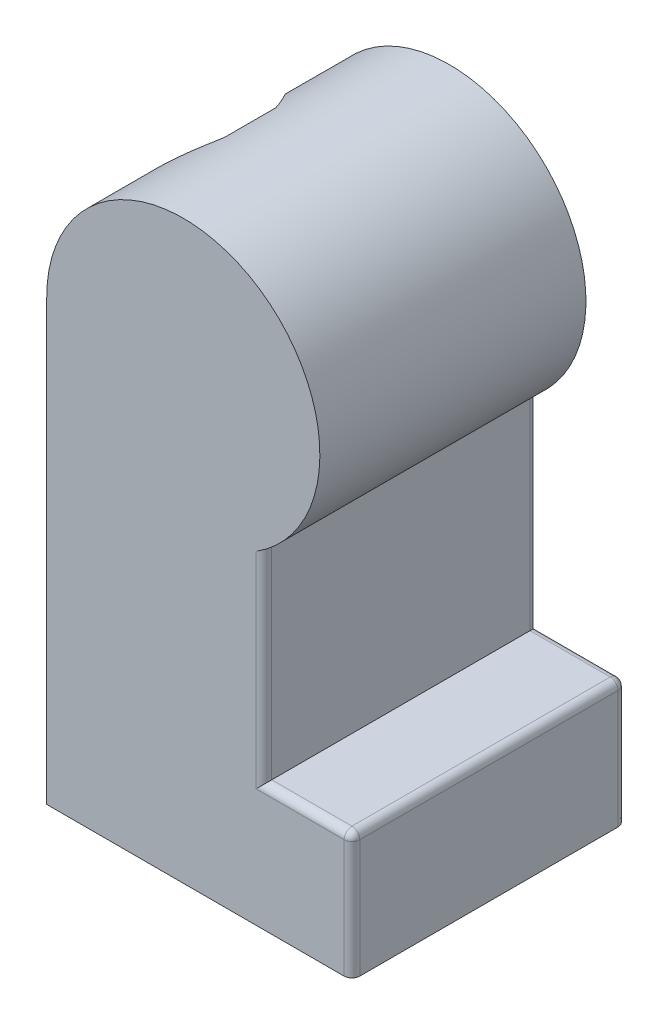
ISO-10303-21;
HEADER;
FILE_DESCRIPTION(('STEP AP214'),'2;1');
FILE_NAME('part.step','',(''),(''),'','','');
FILE_SCHEMA(('AUTOMOTIVE_DESIGN { 1 0 10303 214 1 1 1 1 }'));
ENDSEC;
DATA;
#1=APPLICATION_CONTEXT('core data for automotive mechanical design processes');
#2=APPLICATION_PROTOCOL_DEFINITION('international standard','automotive_design',2000,#1);
#3=PRODUCT_CONTEXT('',#1,'mechanical');
#4=PRODUCT('Part','Part','',(#3));
#5=PRODUCT_RELATED_PRODUCT_CATEGORY('part','',(#4));
#6=PRODUCT_DEFINITION_FORMATION('','',#4);
#7=PRODUCT_DEFINITION_CONTEXT('part definition',#1,'design');
#8=PRODUCT_DEFINITION('design','',#6,#7);
#9=PRODUCT_DEFINITION_SHAPE('','',#8);
#10=(LENGTH_UNIT() NAMED_UNIT(*) SI_UNIT(.MILLI.,.METRE.));
#11=(NAMED_UNIT(*) PLANE_ANGLE_UNIT() SI_UNIT($,.RADIAN.));
#12=(NAMED_UNIT(*) SI_UNIT($,.STERADIAN.) SOLID_ANGLE_UNIT());
#13=UNCERTAINTY_MEASURE_WITH_UNIT(LENGTH_MEASURE(1.E-05),#10,'distance_accuracy_value','');
#14=(GEOMETRIC_REPRESENTATION_CONTEXT(3) GLOBAL_UNCERTAINTY_ASSIGNED_CONTEXT((#13)) GLOBAL_UNIT_ASSIGNED_CONTEXT((#10,
#11,#12)) REPRESENTATION_CONTEXT('',''));
#15=CARTESIAN_POINT('',(0.,0.,0.));
#16=DIRECTION('',(0.,0.,1.));
#17=DIRECTION('',(1.,0.,0.));
#18=AXIS2_PLACEMENT_3D('',#15,#16,#17);
#19=CARTESIAN_POINT('',(1.35,2.450621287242,-1.685762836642));
#20=DIRECTION('',(0.,1.,0.));
#21=DIRECTION('',(0.,0.,-1.));
#22=AXIS2_PLACEMENT_3D('',#19,#20,#21);
#23=PLANE('',#22);
#24=DIRECTION('',(0.,0.,-1.));
#25=VECTOR('',#24,1.);
#26=CARTESIAN_POINT('',(1.29,2.450621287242,-3.1816484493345));
#27=LINE('',#26,#25);
#28=CARTESIAN_POINT('',(1.29,2.450621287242,-1.743296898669));
#29=VERTEX_POINT('',#28);
#30=CARTESIAN_POINT('',(1.29,2.45062128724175,-4.62));
#31=VERTEX_POINT('',#30);
#32=EDGE_CURVE('E237',#29,#31,#27,.T.);
#33=ORIENTED_EDGE('',*,*,#32,.F.);
#34=DIRECTION('',(-1.,0.,0.));
#35=VECTOR('',#34,1.);
#36=CARTESIAN_POINT('',(-0.21,2.45062128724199,-1.743296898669));
#37=LINE('',#36,#35);
#38=CARTESIAN_POINT('',(-1.70999999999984,2.45062128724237,-1.7432968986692));
#39=VERTEX_POINT('',#38);
#40=EDGE_CURVE('E238',#29,#39,#37,.T.);
#41=ORIENTED_EDGE('',*,*,#40,.T.);
#42=DIRECTION('',(0.,0.,1.));
#43=VECTOR('',#42,1.);
#44=CARTESIAN_POINT('',(-1.71,2.450621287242,-3.41683522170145));
#45=LINE('',#44,#43);
#46=CARTESIAN_POINT('',(-1.71,2.45062128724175,-4.62));
#47=VERTEX_POINT('',#46);
#48=EDGE_CURVE('E228',#47,#39,#45,.T.);
#49=ORIENTED_EDGE('',*,*,#48,.F.);
#50=DIRECTION('',(1.,0.,0.));
#51=VECTOR('',#50,1.);
#52=CARTESIAN_POINT('',(-0.21,2.45062128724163,-4.62));
#53=LINE('',#52,#51);
#54=EDGE_CURVE('E510',#47,#31,#53,.T.);
#55=ORIENTED_EDGE('',*,*,#54,.T.);
#56=EDGE_LOOP('',(#33,#41,#49,#55));
#57=FACE_BOUND('',#56,.T.);
#58=ADVANCED_FACE('F16',(#57),#23,.F.);
#59=CARTESIAN_POINT('',(4.11,-8.21,-6.8));
#60=DIRECTION('',(-0.707106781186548,0.707106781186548,0.));
#61=DIRECTION('',(0.707106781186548,0.707106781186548,0.));
#62=AXIS2_PLACEMENT_3D('',#59,#60,#61);
#63=SPHERICAL_SURFACE('',#62,0.2);
#64=CARTESIAN_POINT('',(4.11,-8.21,-6.79999999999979));
#65=DIRECTION('',(0.,0.,-1.));
#66=DIRECTION('',(0.,1.,0.));
#67=AXIS2_PLACEMENT_3D('',#64,#65,#66);
#68=CIRCLE('',#67,0.200000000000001);
#69=CARTESIAN_POINT('',(4.10999999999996,-8.01,-6.7999999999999));
#70=VERTEX_POINT('',#69);
#71=CARTESIAN_POINT('',(4.31,-8.21,-6.7999999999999));
#72=VERTEX_POINT('',#71);
#73=EDGE_CURVE('E486',#70,#72,#68,.T.);
#74=ORIENTED_EDGE('',*,*,#73,.T.);
#75=CARTESIAN_POINT('',(4.11,-8.21,-6.8));
#76=DIRECTION('',(0.,-1.,0.));
#77=DIRECTION('',(1.,0.,0.));
#78=AXIS2_PLACEMENT_3D('',#75,#76,#77);
#79=CIRCLE('',#78,0.200000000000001);
#80=CARTESIAN_POINT('',(4.10999999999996,-8.21,-7.));
#81=VERTEX_POINT('',#80);
#82=EDGE_CURVE('E487',#72,#81,#79,.F.);
#83=ORIENTED_EDGE('',*,*,#82,.T.);
#84=CARTESIAN_POINT('',(4.10999999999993,-8.21,-6.8));
#85=DIRECTION('',(1.,0.,0.));
#86=DIRECTION('',(0.,0.,-1.));
#87=AXIS2_PLACEMENT_3D('',#84,#85,#86);
#88=CIRCLE('',#87,0.2);
#89=EDGE_CURVE('E589',#81,#70,#88,.T.);
#90=ORIENTED_EDGE('',*,*,#89,.T.);
#91=EDGE_LOOP('',(#74,#83,#90));
#92=FACE_BOUND('',#91,.T.);
#93=ADVANCED_FACE('F821',(#92),#63,.T.);
#94=CARTESIAN_POINT('',(0.,0.,-4.62));
#95=DIRECTION('',(0.,0.,-1.));
#96=DIRECTION('',(-1.,0.,0.));
#97=AXIS2_PLACEMENT_3D('',#94,#95,#96);
#98=CYLINDRICAL_SURFACE('',#97,1.16);
#99=CARTESIAN_POINT('',(0.,0.,-6.79999999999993));
#100=DIRECTION('',(0.,0.,-1.));
#101=DIRECTION('',(-1.,0.,0.));
#102=AXIS2_PLACEMENT_3D('',#99,#100,#101);
#103=CIRCLE('',#102,1.16);
#104=CARTESIAN_POINT('',(-1.16,0.,-6.79999999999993));
#105=VERTEX_POINT('',#104);
#106=EDGE_CURVE('E294',#105,#105,#103,.F.);
#107=ORIENTED_EDGE('',*,*,#106,.F.);
#108=EDGE_LOOP('',(#107));
#109=FACE_BOUND('',#108,.T.);
#110=CARTESIAN_POINT('',(0.,0.,-4.62));
#111=DIRECTION('',(0.,0.,-1.));
#112=DIRECTION('',(-1.,0.,0.));
#113=AXIS2_PLACEMENT_3D('',#110,#111,#112);
#114=CIRCLE('',#113,1.16);
#115=CARTESIAN_POINT('',(-1.16,0.,-4.62));
#116=VERTEX_POINT('',#115);
#117=EDGE_CURVE('E509',#116,#116,#114,.F.);
#118=ORIENTED_EDGE('',*,*,#117,.T.);
#119=EDGE_LOOP('',(#118));
#120=FACE_BOUND('',#119,.T.);
#121=ADVANCED_FACE('F593',(#109,#120),#98,.F.);
#122=CARTESIAN_POINT('',(-1.71,3.267067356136,-5.903779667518));
#123=DIRECTION('',(-1.,0.,0.));
#124=DIRECTION('',(0.,-1.,0.));
#125=AXIS2_PLACEMENT_3D('',#122,#123,#124);
#126=PLANE('',#125);
#127=DIRECTION('',(0.,0.,-1.));
#128=VECTOR('',#127,1.);
#129=CARTESIAN_POINT('',(-1.71,3.042367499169,-3.41683522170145));
#130=LINE('',#129,#128);
#131=CARTESIAN_POINT('',(-1.70999999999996,3.04236749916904,-2.75855950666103));
#132=VERTEX_POINT('',#131);
#133=CARTESIAN_POINT('',(-1.70999999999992,3.04236749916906,-4.07644049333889));
#134=VERTEX_POINT('',#133);
#135=EDGE_CURVE('E208',#132,#134,#130,.T.);
#136=ORIENTED_EDGE('',*,*,#135,.T.);
#137=CARTESIAN_POINT('',(-1.70999999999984,0.745,-3.4175));
#138=DIRECTION('',(-1.,0.,0.));
#139=DIRECTION('',(0.,0.,1.));
#140=AXIS2_PLACEMENT_3D('',#137,#138,#139);
#141=CIRCLE('',#140,2.39);
#142=CARTESIAN_POINT('',(-1.70999999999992,-1.32045243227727,-4.61999999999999));
#143=VERTEX_POINT('',#142);
#144=EDGE_CURVE('E286',#143,#134,#141,.F.);
#145=ORIENTED_EDGE('',*,*,#144,.F.);
#146=DIRECTION('',(0.,1.,0.));
#147=VECTOR('',#146,1.);
#148=CARTESIAN_POINT('',(-1.71,0.565084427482,-4.62));
#149=LINE('',#148,#147);
#150=EDGE_CURVE('E514',#143,#47,#149,.T.);
#151=ORIENTED_EDGE('',*,*,#150,.T.);
#152=ORIENTED_EDGE('',*,*,#48,.T.);
#153=CARTESIAN_POINT('',(-1.70999999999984,0.745,-3.4175));
#154=DIRECTION('',(-1.,0.,0.));
#155=DIRECTION('',(0.,0.,1.));
#156=AXIS2_PLACEMENT_3D('',#153,#154,#155);
#157=CIRCLE('',#156,2.39);
#158=EDGE_CURVE('E20',#39,#132,#157,.T.);
#159=ORIENTED_EDGE('',*,*,#158,.T.);
#160=EDGE_LOOP('',(#136,#145,#151,#152,#159));
#161=FACE_BOUND('',#160,.T.);
#162=ADVANCED_FACE('F226',(#161),#126,.T.);
#163=CARTESIAN_POINT('',(-1.71,3.267067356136,-5.903779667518));
#164=DIRECTION('',(-1.,0.,0.));
#165=DIRECTION('',(0.,-1.,0.));
#166=AXIS2_PLACEMENT_3D('',#163,#164,#165);
#167=PLANE('',#166);
#168=DIRECTION('',(0.,-1.,0.));
#169=VECTOR('',#168,1.);
#170=CARTESIAN_POINT('',(-1.71,0.745,-1.743296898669));
#171=LINE('',#170,#169);
#172=CARTESIAN_POINT('',(-1.70999999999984,-0.960621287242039,-1.74329689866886));
#173=VERTEX_POINT('',#172);
#174=EDGE_CURVE('E216',#39,#173,#171,.T.);
#175=ORIENTED_EDGE('',*,*,#174,.T.);
#176=CARTESIAN_POINT('',(-1.70999999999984,0.745,-3.4175));
#177=DIRECTION('',(-1.,0.,0.));
#178=DIRECTION('',(0.,0.,1.));
#179=AXIS2_PLACEMENT_3D('',#176,#177,#178);
#180=CIRCLE('',#179,2.39);
#181=EDGE_CURVE('E503',#39,#173,#180,.F.);
#182=ORIENTED_EDGE('',*,*,#181,.F.);
#183=EDGE_LOOP('',(#175,#182));
#184=FACE_BOUND('',#183,.T.);
#185=ADVANCED_FACE('F827',(#184),#167,.T.);
#186=CARTESIAN_POINT('',(1.35,-1.028846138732,-1.743296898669));
#187=DIRECTION('',(0.,0.,1.));
#188=DIRECTION('',(0.,1.,0.));
#189=AXIS2_PLACEMENT_3D('',#186,#187,#188);
#190=PLANE('',#189);
#191=DIRECTION('',(0.,1.,0.));
#192=VECTOR('',#191,1.);
#193=CARTESIAN_POINT('',(1.29,0.4026481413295,-1.743296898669));
#194=LINE('',#193,#192);
#195=CARTESIAN_POINT('',(1.29,-0.960621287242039,-1.74329689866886));
#196=VERTEX_POINT('',#195);
#197=EDGE_CURVE('E234',#196,#29,#194,.T.);
#198=ORIENTED_EDGE('',*,*,#197,.F.);
#199=DIRECTION('',(1.,0.,0.));
#200=VECTOR('',#199,1.);
#201=CARTESIAN_POINT('',(-1.1,-0.9606212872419,-1.74329689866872));
#202=LINE('',#201,#200);
#203=EDGE_CURVE('E499',#173,#196,#202,.T.);
#204=ORIENTED_EDGE('',*,*,#203,.F.);
#205=ORIENTED_EDGE('',*,*,#174,.F.);
#206=ORIENTED_EDGE('',*,*,#40,.F.);
#207=EDGE_LOOP('',(#198,#204,#205,#206));
#208=FACE_BOUND('',#207,.T.);
#209=ADVANCED_FACE('F987',(#208),#190,.F.);
#210=CARTESIAN_POINT('',(1.29,-1.727243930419,-1.685762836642));
#211=DIRECTION('',(-1.,0.,0.));
#212=DIRECTION('',(0.,1.,0.));
#213=AXIS2_PLACEMENT_3D('',#210,#211,#212);
#214=PLANE('',#213);
#215=ORIENTED_EDGE('',*,*,#197,.T.);
#216=ORIENTED_EDGE('',*,*,#32,.T.);
#217=DIRECTION('',(0.,-1.,0.));
#218=VECTOR('',#217,1.);
#219=CARTESIAN_POINT('',(1.29,0.565084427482,-4.62));
#220=LINE('',#219,#218);
#221=CARTESIAN_POINT('',(1.29,-1.32045243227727,-4.61999999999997));
#222=VERTEX_POINT('',#221);
#223=EDGE_CURVE('E507',#31,#222,#220,.T.);
#224=ORIENTED_EDGE('',*,*,#223,.T.);
#225=CARTESIAN_POINT('',(1.29,0.745,-3.4175));
#226=DIRECTION('',(-1.,0.,0.));
#227=DIRECTION('',(0.,0.,1.));
#228=AXIS2_PLACEMENT_3D('',#225,#226,#227);
#229=CIRCLE('',#228,2.39);
#230=EDGE_CURVE('E502',#196,#222,#229,.F.);
#231=ORIENTED_EDGE('',*,*,#230,.F.);
#232=EDGE_LOOP('',(#215,#216,#224,#231));
#233=FACE_BOUND('',#232,.T.);
#234=ADVANCED_FACE('F599',(#233),#214,.T.);
#235=CARTESIAN_POINT('',(1.35,2.526042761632,-4.62));
#236=DIRECTION('',(0.,0.,-1.));
#237=DIRECTION('',(0.,-1.,0.));
#238=AXIS2_PLACEMENT_3D('',#235,#236,#237);
#239=PLANE('',#238);
#240=ORIENTED_EDGE('',*,*,#117,.F.);
#241=EDGE_LOOP('',(#240));
#242=FACE_BOUND('',#241,.T.);
#243=ORIENTED_EDGE('',*,*,#223,.F.);
#244=ORIENTED_EDGE('',*,*,#54,.F.);
#245=ORIENTED_EDGE('',*,*,#150,.F.);
#246=DIRECTION('',(-1.,0.,0.));
#247=VECTOR('',#246,1.);
#248=CARTESIAN_POINT('',(-1.1,-1.32045243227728,-4.61999999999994));
#249=LINE('',#248,#247);
#250=EDGE_CURVE('E504',#222,#143,#249,.T.);
#251=ORIENTED_EDGE('',*,*,#250,.F.);
#252=EDGE_LOOP('',(#243,#244,#245,#251));
#253=FACE_BOUND('',#252,.T.);
#254=ADVANCED_FACE('F595',(#242,#253),#239,.F.);
#255=CARTESIAN_POINT('',(1.8465,-8.21,-6.8));
#256=DIRECTION('',(1.,0.,0.));
#257=DIRECTION('',(0.,0.,-1.));
#258=AXIS2_PLACEMENT_3D('',#255,#256,#257);
#259=CYLINDRICAL_SURFACE('',#258,0.2);
#260=CARTESIAN_POINT('',(1.86000000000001,-8.21,-6.8));
#261=DIRECTION('',(0.707106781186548,-0.707106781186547,0.));
#262=DIRECTION('',(0.707106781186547,0.707106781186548,0.));
#263=AXIS2_PLACEMENT_3D('',#260,#261,#262);
#264=ELLIPSE('',#263,0.282842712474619,0.2);
#265=CARTESIAN_POINT('',(1.86,-8.21,-7.));
#266=VERTEX_POINT('',#265);
#267=CARTESIAN_POINT('',(2.06,-8.01000000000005,-6.8));
#268=VERTEX_POINT('',#267);
#269=EDGE_CURVE('E587',#266,#268,#264,.T.);
#270=ORIENTED_EDGE('',*,*,#269,.T.);
#271=DIRECTION('',(-1.,0.,0.));
#272=VECTOR('',#271,1.);
#273=CARTESIAN_POINT('',(3.085,-8.01,-6.8));
#274=LINE('',#273,#272);
#275=EDGE_CURVE('E389',#70,#268,#274,.T.);
#276=ORIENTED_EDGE('',*,*,#275,.F.);
#277=ORIENTED_EDGE('',*,*,#89,.F.);
#278=DIRECTION('',(-1.,0.,0.));
#279=VECTOR('',#278,1.);
#280=CARTESIAN_POINT('',(0.41,-8.21,-7.));
#281=LINE('',#280,#279);
#282=EDGE_CURVE('E364',#81,#266,#281,.T.);
#283=ORIENTED_EDGE('',*,*,#282,.T.);
#284=EDGE_LOOP('',(#270,#276,#277,#283));
#285=FACE_BOUND('',#284,.T.);
#286=ADVANCED_FACE('F598',(#285),#259,.T.);
#287=CARTESIAN_POINT('',(1.86,-2.78482251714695,-6.8));
#288=DIRECTION('',(0.,-1.,0.));
#289=DIRECTION('',(1.,0.,0.));
#290=AXIS2_PLACEMENT_3D('',#287,#288,#289);
#291=CYLINDRICAL_SURFACE('',#290,0.2);
#292=DIRECTION('',(0.,1.,0.));
#293=VECTOR('',#292,1.);
#294=CARTESIAN_POINT('',(1.86,-6.4504639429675,-7.));
#295=LINE('',#294,#293);
#296=CARTESIAN_POINT('',(1.86000000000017,-3.18692641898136,-7.));
#297=VERTEX_POINT('',#296);
#298=EDGE_CURVE('E498',#266,#297,#295,.T.);
#299=ORIENTED_EDGE('',*,*,#298,.T.);
#300=CARTESIAN_POINT('',(2.06000000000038,-2.81717944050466,-6.80000000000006));
#301=CARTESIAN_POINT('',(2.05999560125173,-2.81718264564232,-6.80098943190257));
#302=CARTESIAN_POINT('',(2.05998428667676,-2.81720002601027,-6.80197878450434));
#303=CARTESIAN_POINT('',(2.0599479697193,-2.81726281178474,-6.803949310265));
#304=CARTESIAN_POINT('',(2.05992306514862,-2.81730801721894,-6.80493049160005));
#305=CARTESIAN_POINT('',(2.05985985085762,-2.81742580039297,-6.80688448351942));
#306=CARTESIAN_POINT('',(2.05982162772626,-2.81749820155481,-6.80785730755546));
#307=CARTESIAN_POINT('',(2.05973206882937,-2.81766969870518,-6.80979440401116));
#308=CARTESIAN_POINT('',(2.05968080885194,-2.81776864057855,-6.81075869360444));
#309=CARTESIAN_POINT('',(2.05956546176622,-2.8179925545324,-6.81267856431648));
#310=CARTESIAN_POINT('',(2.05950144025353,-2.81811739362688,-6.81363416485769));
#311=CARTESIAN_POINT('',(2.05936086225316,-2.81839242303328,-6.81553646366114));
#312=CARTESIAN_POINT('',(2.05928436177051,-2.81854250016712,-6.81648318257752));
#313=CARTESIAN_POINT('',(2.05903688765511,-2.81902897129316,-6.81930500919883));
#314=CARTESIAN_POINT('',(2.05884731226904,-2.81940282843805,-6.82117219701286));
#315=CARTESIAN_POINT('',(2.0584212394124,-2.82024438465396,-6.82486915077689));
#316=CARTESIAN_POINT('',(2.05818499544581,-2.82071157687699,-6.82669906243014));
#317=CARTESIAN_POINT('',(2.05766789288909,-2.82173446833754,-6.83032076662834));
#318=CARTESIAN_POINT('',(2.05738718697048,-2.82228986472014,-6.83211266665));
#319=CARTESIAN_POINT('',(2.05678346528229,-2.82348389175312,-6.83565758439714));
#320=CARTESIAN_POINT('',(2.05646052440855,-2.82412237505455,-6.83741066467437));
#321=CARTESIAN_POINT('',(2.05577462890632,-2.82547739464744,-6.84087737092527));
#322=CARTESIAN_POINT('',(2.05541169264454,-2.82619389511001,-6.84259101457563));
#323=CARTESIAN_POINT('',(2.05464810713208,-2.82769984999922,-6.84597837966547));
#324=CARTESIAN_POINT('',(2.05424743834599,-2.82848934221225,-6.84765207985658));
#325=CARTESIAN_POINT('',(2.05341070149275,-2.83013626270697,-6.85095920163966));
#326=CARTESIAN_POINT('',(2.05297459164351,-2.83099377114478,-6.85259257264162));
#327=CARTESIAN_POINT('',(2.052069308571,-2.83277178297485,-6.85581877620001));
#328=CARTESIAN_POINT('',(2.05160008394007,-2.83369238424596,-6.85741154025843));
#329=CARTESIAN_POINT('',(2.0506309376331,-2.83559171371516,-6.86055636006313));
#330=CARTESIAN_POINT('',(2.05013096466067,-2.83657053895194,-6.86210834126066));
#331=CARTESIAN_POINT('',(2.0491027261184,-2.83858151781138,-6.86517150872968));
#332=CARTESIAN_POINT('',(2.0485744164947,-2.83961375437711,-6.86668262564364));
#333=CARTESIAN_POINT('',(2.04749195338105,-2.84172682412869,-6.86966405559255));
#334=CARTESIAN_POINT('',(2.04693776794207,-2.84280771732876,-6.87113431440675));
#335=CARTESIAN_POINT('',(2.04580605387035,-2.8450134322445,-6.87403409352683));
#336=CARTESIAN_POINT('',(2.04522850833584,-2.84613828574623,-6.87546358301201));
#337=CARTESIAN_POINT('',(2.04405262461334,-2.84842731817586,-6.87828195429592));
#338=CARTESIAN_POINT('',(2.04345428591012,-2.84959149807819,-6.87967083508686));
#339=CARTESIAN_POINT('',(2.04223944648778,-2.85195463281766,-6.88240819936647));
#340=CARTESIAN_POINT('',(2.04162296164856,-2.853153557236,-6.883756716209));
#341=CARTESIAN_POINT('',(2.04037425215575,-2.85558210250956,-6.88641398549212));
#342=CARTESIAN_POINT('',(2.0397420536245,-2.85681167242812,-6.88772279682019));
#343=CARTESIAN_POINT('',(2.03846247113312,-2.85929914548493,-6.89030177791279));
#344=CARTESIAN_POINT('',(2.03781510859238,-2.86055700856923,-6.89157199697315));
#345=CARTESIAN_POINT('',(2.03650578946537,-2.86309906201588,-6.89407527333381));
#346=CARTESIAN_POINT('',(2.03584384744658,-2.86438322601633,-6.89530836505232));
#347=CARTESIAN_POINT('',(2.03450603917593,-2.86697601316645,-6.89773885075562));
#348=CARTESIAN_POINT('',(2.03383018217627,-2.86828462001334,-6.89893626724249));
#349=CARTESIAN_POINT('',(2.03246531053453,-2.8709245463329,-6.90129685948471));
#350=CARTESIAN_POINT('',(2.03177630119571,-2.87225585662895,-6.90246004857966));
#351=CARTESIAN_POINT('',(2.03038597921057,-2.87493956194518,-6.90475362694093));
#352=CARTESIAN_POINT('',(2.02968466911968,-2.87629195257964,-6.90588402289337));
#353=CARTESIAN_POINT('',(2.02827068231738,-2.87901630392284,-6.90811343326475));
#354=CARTESIAN_POINT('',(2.02755800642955,-2.88038826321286,-6.90921244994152));
#355=CARTESIAN_POINT('',(2.02612231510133,-2.88315034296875,-6.91138050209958));
#356=CARTESIAN_POINT('',(2.02539929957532,-2.88454046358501,-6.9124495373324));
#357=CARTESIAN_POINT('',(2.02394399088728,-2.88733758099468,-6.91455897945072));
#358=CARTESIAN_POINT('',(2.02321169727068,-2.88874457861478,-6.91559938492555));
#359=CARTESIAN_POINT('',(2.02173809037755,-2.89157433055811,-6.91765229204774));
#360=CARTESIAN_POINT('',(2.02099677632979,-2.89299708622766,-6.91866479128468));
#361=CARTESIAN_POINT('',(2.01950545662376,-2.89585729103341,-6.92066263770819));
#362=CARTESIAN_POINT('',(2.01875545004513,-2.89729474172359,-6.92164798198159));
#363=CARTESIAN_POINT('',(2.01724710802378,-2.90018332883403,-6.92359225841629));
#364=CARTESIAN_POINT('',(2.01648877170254,-2.90163446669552,-6.92455118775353));
#365=CARTESIAN_POINT('',(2.01496417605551,-2.90454947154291,-6.92644336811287));
#366=CARTESIAN_POINT('',(2.01419791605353,-2.90601333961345,-6.92737661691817));
#367=CARTESIAN_POINT('',(2.01265791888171,-2.90895289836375,-6.92921816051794));
#368=CARTESIAN_POINT('',(2.01188418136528,-2.91042858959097,-6.93012645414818));
#369=CARTESIAN_POINT('',(2.01032971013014,-2.9133909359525,-6.93191879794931));
#370=CARTESIAN_POINT('',(2.00954897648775,-2.91487759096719,-6.93280284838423));
#371=CARTESIAN_POINT('',(2.00798104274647,-2.91786105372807,-6.9345474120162));
#372=CARTESIAN_POINT('',(2.00719384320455,-2.91935786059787,-6.93540792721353));
#373=CARTESIAN_POINT('',(2.00561346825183,-2.92236091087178,-6.93710610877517));
#374=CARTESIAN_POINT('',(2.00482029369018,-2.92386715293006,-6.93794377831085));
#375=CARTESIAN_POINT('',(2.00322808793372,-2.92688849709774,-6.93959679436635));
#376=CARTESIAN_POINT('',(2.00242905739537,-2.92840359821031,-6.94041214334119));
#377=CARTESIAN_POINT('',(2.00082530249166,-2.93144214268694,-6.9420210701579));
#378=CARTESIAN_POINT('',(2.0000205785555,-2.93296558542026,-6.9428146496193));
#379=CARTESIAN_POINT('',(1.99840561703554,-2.9360203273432,-6.94438057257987));
#380=CARTESIAN_POINT('',(1.9975953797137,-2.93755162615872,-6.9451529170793));
#381=CARTESIAN_POINT('',(1.99596959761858,-2.94062162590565,-6.94667689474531));
#382=CARTESIAN_POINT('',(1.99515405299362,-2.94216032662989,-6.94742852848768));
#383=CARTESIAN_POINT('',(1.99351788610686,-2.94524470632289,-6.94891159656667));
#384=CARTESIAN_POINT('',(1.99269726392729,-2.94679038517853,-6.94964303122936));
#385=CARTESIAN_POINT('',(1.9910511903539,-2.94988832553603,-6.95108619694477));
#386=CARTESIAN_POINT('',(1.99022573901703,-2.95144058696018,-6.9517979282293));
#387=CARTESIAN_POINT('',(1.98857029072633,-2.95455132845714,-6.9532021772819));
#388=CARTESIAN_POINT('',(1.98774029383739,-2.9561098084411,-6.95389469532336));
#389=CARTESIAN_POINT('',(1.98607599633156,-2.95923264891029,-6.95526096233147));
#390=CARTESIAN_POINT('',(1.98524169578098,-2.9607970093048,-6.95593471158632));
#391=CARTESIAN_POINT('',(1.98356885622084,-2.96393127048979,-6.95726377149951));
#392=CARTESIAN_POINT('',(1.98273031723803,-2.96550117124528,-6.95791908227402));
#393=CARTESIAN_POINT('',(1.98104910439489,-2.96864620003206,-6.95921160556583));
#394=CARTESIAN_POINT('',(1.98020643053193,-2.97022132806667,-6.95984881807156));
#395=CARTESIAN_POINT('',(1.97851705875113,-2.97337651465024,-6.96110547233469));
#396=CARTESIAN_POINT('',(1.97767036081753,-2.97495657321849,-6.96172491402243));
#397=CARTESIAN_POINT('',(1.97597306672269,-2.97812134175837,-6.96294634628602));
#398=CARTESIAN_POINT('',(1.97512247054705,-2.97970605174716,-6.96354833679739));
#399=CARTESIAN_POINT('',(1.97341751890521,-2.98287986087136,-6.9647351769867));
#400=CARTESIAN_POINT('',(1.97256316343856,-2.98446896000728,-6.96532002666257));
#401=CARTESIAN_POINT('',(1.9708508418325,-2.98765130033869,-6.96647288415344));
#402=CARTESIAN_POINT('',(1.96999287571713,-2.98924454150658,-6.96704089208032));
#403=CARTESIAN_POINT('',(1.96827350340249,-2.99243493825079,-6.96816036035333));
#404=CARTESIAN_POINT('',(1.96741209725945,-2.99403209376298,-6.96871182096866));
#405=CARTESIAN_POINT('',(1.96568597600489,-2.99723010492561,-6.96979845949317));
#406=CARTESIAN_POINT('',(1.96482126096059,-2.99883096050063,-6.97033363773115));
#407=CARTESIAN_POINT('',(1.96308856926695,-3.00203615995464,-6.9713879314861));
#408=CARTESIAN_POINT('',(1.96222059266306,-3.00364050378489,-6.97190704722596));
#409=CARTESIAN_POINT('',(1.96048144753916,-3.00685248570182,-6.97292943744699));
#410=CARTESIAN_POINT('',(1.95961027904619,-3.00846012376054,-6.97343271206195));
#411=CARTESIAN_POINT('',(1.95786482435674,-3.01167850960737,-6.97442363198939));
#412=CARTESIAN_POINT('',(1.95699053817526,-3.01328925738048,-6.974911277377));
#413=CARTESIAN_POINT('',(1.95523893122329,-3.01651368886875,-6.97587114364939));
#414=CARTESIAN_POINT('',(1.95436161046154,-3.01812737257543,-6.97634336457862));
#415=CARTESIAN_POINT('',(1.95260402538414,-3.02135751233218,-6.97727257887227));
#416=CARTESIAN_POINT('',(1.95172376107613,-3.02297396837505,-6.97772957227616));
#417=CARTESIAN_POINT('',(1.94996038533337,-3.0262094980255,-6.97862851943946));
#418=CARTESIAN_POINT('',(1.94907727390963,-3.02782857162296,-6.9790704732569));
#419=CARTESIAN_POINT('',(1.94730831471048,-3.03106919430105,-6.97993952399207));
#420=CARTESIAN_POINT('',(1.94642246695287,-3.03269074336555,-6.98036662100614));
#421=CARTESIAN_POINT('',(1.9446481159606,-3.03593617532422,-6.98120611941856));
#422=CARTESIAN_POINT('',(1.94375961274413,-3.03756005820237,-6.98161852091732));
#423=CARTESIAN_POINT('',(1.94197998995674,-3.04081001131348,-6.98242876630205));
#424=CARTESIAN_POINT('',(1.94108887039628,-3.04243608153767,-6.98282661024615));
#425=CARTESIAN_POINT('',(1.9393040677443,-3.04569027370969,-6.98360787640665));
#426=CARTESIAN_POINT('',(1.93841038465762,-3.04731839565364,-6.98399129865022));
#427=CARTESIAN_POINT('',(1.93662051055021,-3.05057656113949,-6.98474385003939));
#428=CARTESIAN_POINT('',(1.93572431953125,-3.05220660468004,-6.98511297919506));
#429=CARTESIAN_POINT('',(1.93392949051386,-3.05546848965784,-6.98583706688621));
#430=CARTESIAN_POINT('',(1.93303085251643,-3.05710033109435,-6.9861920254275));
#431=CARTESIAN_POINT('',(1.93123119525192,-3.06036569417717,-6.98688788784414));
#432=CARTESIAN_POINT('',(1.9303301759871,-3.06199921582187,-6.98722879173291));
#433=CARTESIAN_POINT('',(1.9285258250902,-3.06526782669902,-6.98789665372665));
#434=CARTESIAN_POINT('',(1.92762249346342,-3.06690291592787,-6.98822361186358));
#435=CARTESIAN_POINT('',(1.92581359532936,-3.0701745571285,-6.98886368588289));
#436=CARTESIAN_POINT('',(1.92490802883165,-3.07181110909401,-6.98917680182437));
#437=CARTESIAN_POINT('',(1.92309471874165,-3.07508556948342,-6.98978928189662));
#438=CARTESIAN_POINT('',(1.92218697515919,-3.07672347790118,-6.99008864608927));
#439=CARTESIAN_POINT('',(1.92036934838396,-3.08000054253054,-6.99067370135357));
#440=CARTESIAN_POINT('',(1.91945946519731,-3.08163969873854,-6.99095939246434));
#441=CARTESIAN_POINT('',(1.91763760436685,-3.08491915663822,-6.99151717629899));
#442=CARTESIAN_POINT('',(1.91672562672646,-3.08655945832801,-6.99178926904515));
#443=CARTESIAN_POINT('',(1.91489962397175,-3.0898411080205,-6.99231992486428));
#444=CARTESIAN_POINT('',(1.9139855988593,-3.09148245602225,-6.99257848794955));
#445=CARTESIAN_POINT('',(1.91215555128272,-3.0947661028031,-6.99308214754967));
#446=CARTESIAN_POINT('',(1.91123952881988,-3.09640840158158,-6.99332724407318));
#447=CARTESIAN_POINT('',(1.90940553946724,-3.09969385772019,-6.99380402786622));
#448=CARTESIAN_POINT('',(1.90848757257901,-3.10133701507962,-6.99403571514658));
#449=CARTESIAN_POINT('',(1.90664974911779,-3.10462409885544,-6.9944857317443));
#450=CARTESIAN_POINT('',(1.90572989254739,-3.10626802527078,-6.99470406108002));
#451=CARTESIAN_POINT('',(1.90388834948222,-3.10955656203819,-6.99512740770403));
#452=CARTESIAN_POINT('',(1.90296666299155,-3.11120117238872,-6.99533242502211));
#453=CARTESIAN_POINT('',(1.90112150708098,-3.1144909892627,-6.99572918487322));
#454=CARTESIAN_POINT('',(1.90019803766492,-3.11613619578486,-6.99592092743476));
#455=CARTESIAN_POINT('',(1.89834935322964,-3.11942711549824,-6.9962911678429));
#456=CARTESIAN_POINT('',(1.89742413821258,-3.12107282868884,-6.99646966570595));
#457=CARTESIAN_POINT('',(1.89557200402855,-3.12436467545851,-6.9968134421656));
#458=CARTESIAN_POINT('',(1.89464508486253,-3.12601080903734,-6.99697872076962));
#459=CARTESIAN_POINT('',(1.89278958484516,-3.12930341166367,-6.99729607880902));
#460=CARTESIAN_POINT('',(1.891861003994,-3.13094988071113,-6.99744815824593));
#461=CARTESIAN_POINT('',(1.89000222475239,-3.13424307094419,-6.99773913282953));
#462=CARTESIAN_POINT('',(1.88907202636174,-3.13588979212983,-6.99787802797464));
#463=CARTESIAN_POINT('',(1.88721005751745,-3.13918340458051,-6.99814264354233));
#464=CARTESIAN_POINT('',(1.88627828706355,-3.14083029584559,-6.99826836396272));
#465=CARTESIAN_POINT('',(1.88441322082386,-3.14412416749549,-6.99850663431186));
#466=CARTESIAN_POINT('',(1.883479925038,-3.14577114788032,-6.99861918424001));
#467=CARTESIAN_POINT('',(1.88161185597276,-3.14906511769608,-6.99883111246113));
#468=CARTESIAN_POINT('',(1.88067708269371,-3.150712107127,-6.99893049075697));
#469=CARTESIAN_POINT('',(1.87880610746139,-3.15400601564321,-6.99911606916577));
#470=CARTESIAN_POINT('',(1.87786990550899,-3.15565293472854,-6.99920226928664));
#471=CARTESIAN_POINT('',(1.87599612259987,-3.15894662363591,-6.99936147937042));
#472=CARTESIAN_POINT('',(1.87505854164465,-3.16059339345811,-6.99943448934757));
#473=CARTESIAN_POINT('',(1.87318205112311,-3.16388670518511,-6.99956730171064));
#474=CARTESIAN_POINT('',(1.87224314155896,-3.16553324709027,-6.99962710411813));
#475=CARTESIAN_POINT('',(1.87036404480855,-3.16882602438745,-6.99973347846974));
#476=CARTESIAN_POINT('',(1.86942385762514,-3.17047225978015,-6.99978005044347));
#477=CARTESIAN_POINT('',(1.867542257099,-3.17376434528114,-6.99985993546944));
#478=CARTESIAN_POINT('',(1.86660084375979,-3.17541019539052,-6.99989324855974));
#479=CARTESIAN_POINT('',(1.86471684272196,-3.17870143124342,-6.99994658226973));
#480=CARTESIAN_POINT('',(1.86377425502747,-3.18034681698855,-6.99996660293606));
#481=CARTESIAN_POINT('',(1.86188795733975,-3.18363704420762,-6.99999331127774));
#482=CARTESIAN_POINT('',(1.86094424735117,-3.18528188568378,-6.99999999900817));
#483=CARTESIAN_POINT('',(1.86000000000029,-3.1869264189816,-7.));
#484=B_SPLINE_CURVE_WITH_KNOTS('',3,(#300,#301,#302,#303,#304,#305,#306,#307,#308,#309,#310,
#311,#312,#313,#314,#315,#316,#317,#318,#319,#320,#321,#322,#323,#324,#325,#326,#327,#328,#329,
#330,#331,#332,#333,#334,#335,#336,#337,#338,#339,#340,#341,#342,#343,#344,#345,#346,#347,#348,
#349,#350,#351,#352,#353,#354,#355,#356,#357,#358,#359,#360,#361,#362,#363,#364,#365,#366,#367,
#368,#369,#370,#371,#372,#373,#374,#375,#376,#377,#378,#379,#380,#381,#382,#383,#384,#385,#386,
#387,#388,#389,#390,#391,#392,#393,#394,#395,#396,#397,#398,#399,#400,#401,#402,#403,#404,#405,
#406,#407,#408,#409,#410,#411,#412,#413,#414,#415,#416,#417,#418,#419,#420,#421,#422,#423,#424,
#425,#426,#427,#428,#429,#430,#431,#432,#433,#434,#435,#436,#437,#438,#439,#440,#441,#442,#443,
#444,#445,#446,#447,#448,#449,#450,#451,#452,#453,#454,#455,#456,#457,#458,#459,#460,#461,#462,
#463,#464,#465,#466,#467,#468,#469,#470,#471,#472,#473,#474,#475,#476,#477,#478,#479,#480,#481,
#482,#483),.UNSPECIFIED.,.F.,.F.,(4,2,2,2,2,2,2,2,2,2,2,2,2,2,2,2,2,2,2,2,2,2,2,2,2,2,2,2,2,2,2,
2,2,2,2,2,2,2,2,2,2,2,2,2,2,2,2,2,2,2,2,2,2,2,2,2,2,2,2,2,2,2,2,2,2,2,2,2,2,2,2,2,2,2,2,2,2,2,2,
2,2,2,2,2,2,2,2,2,2,2,2,4),(0.,0.00296821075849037,0.00591533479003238,0.008843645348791,
0.0117553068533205,0.0146523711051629,0.0175367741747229,0.0232741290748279,0.0289811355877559,
0.0346689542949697,0.0403468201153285,0.0460220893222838,0.051700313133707,0.0573853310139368,
0.0630793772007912,0.0687831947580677,0.0744961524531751,0.0802163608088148,0.085940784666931,
0.0916653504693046,0.0973850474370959,0.103095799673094,0.10879892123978,0.114496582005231,
0.120190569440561,0.125882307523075,0.131572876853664,0.137263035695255,0.142953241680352,
0.148643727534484,0.154334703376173,0.160026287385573,0.165718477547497,0.171411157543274,
0.177104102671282,0.182796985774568,0.188489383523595,0.194180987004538,0.199871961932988,
0.20556251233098,0.211252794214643,0.216942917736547,0.222632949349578,0.228322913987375,
0.234012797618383,0.239702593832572,0.245392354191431,0.251082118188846,0.256771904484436,
0.262461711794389,0.268151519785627,0.27384128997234,0.279530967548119,0.285220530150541,
0.290910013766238,0.296599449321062,0.302288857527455,0.30797824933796,0.313667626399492,
0.319356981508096,0.325046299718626,0.330735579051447,0.336424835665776,0.342114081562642,
0.347803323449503,0.353492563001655,0.359181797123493,0.364871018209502,0.370560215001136,
0.376249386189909,0.381938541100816,0.387627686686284,0.393316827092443,0.399005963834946,
0.404695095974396,0.410384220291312,0.416073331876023,0.42176243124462,0.42745152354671,
0.433140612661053,0.438829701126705,0.44451879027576,0.450207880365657,0.455896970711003,
0.461586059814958,0.467275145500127,0.472964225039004,0.478653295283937,0.484342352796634,
0.490031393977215,0.495720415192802,0.501409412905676),.UNSPECIFIED.);
#485=CARTESIAN_POINT('',(2.0599999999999,-2.81717944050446,-6.80000000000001));
#486=VERTEX_POINT('',#485);
#487=EDGE_CURVE('E488',#297,#486,#484,.F.);
#488=ORIENTED_EDGE('',*,*,#487,.T.);
#489=DIRECTION('',(0.,1.,0.));
#490=VECTOR('',#489,1.);
#491=CARTESIAN_POINT('',(2.06,-5.413589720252,-6.8));
#492=LINE('',#491,#490);
#493=EDGE_CURVE('E295',#268,#486,#492,.T.);
#494=ORIENTED_EDGE('',*,*,#493,.F.);
#495=ORIENTED_EDGE('',*,*,#269,.F.);
#496=EDGE_LOOP('',(#299,#488,#494,#495));
#497=FACE_BOUND('',#496,.T.);
#498=ADVANCED_FACE('F252',(#497),#291,.T.);
#499=CARTESIAN_POINT('',(0.,0.,-6.8));
#500=DIRECTION('',(0.,0.,-1.));
#501=DIRECTION('',(0.598853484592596,-0.800858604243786,0.));
#502=AXIS2_PLACEMENT_3D('',#499,#500,#501);
#503=TOROIDAL_SURFACE('',#502,3.69000000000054,0.2);
#504=CARTESIAN_POINT('',(0.,0.,-6.8));
#505=DIRECTION('',(0.,0.,-1.));
#506=DIRECTION('',(-1.,0.,0.));
#507=AXIS2_PLACEMENT_3D('',#504,#505,#506);
#508=CIRCLE('',#507,3.49000000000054);
#509=CARTESIAN_POINT('',(-3.49000000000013,-2.06924033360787E-13,-6.80000000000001));
#510=VERTEX_POINT('',#509);
#511=EDGE_CURVE('E276',#486,#510,#508,.T.);
#512=ORIENTED_EDGE('',*,*,#511,.F.);
#513=ORIENTED_EDGE('',*,*,#487,.F.);
#514=CARTESIAN_POINT('',(0.,0.,-7.));
#515=DIRECTION('',(0.,0.,-1.));
#516=DIRECTION('',(0.504065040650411,-0.86366569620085,0.));
#517=AXIS2_PLACEMENT_3D('',#514,#515,#516);
#518=CIRCLE('',#517,3.69000000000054);
#519=CARTESIAN_POINT('',(-3.29000000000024,-1.6709278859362,-7.));
#520=VERTEX_POINT('',#519);
#521=EDGE_CURVE('E279',#297,#520,#518,.T.);
#522=ORIENTED_EDGE('',*,*,#521,.T.);
#523=CARTESIAN_POINT('',(-3.29000000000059,-1.67092788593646,-7.));
#524=CARTESIAN_POINT('',(-3.29563570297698,-1.64798371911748,-6.99999986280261));
#525=CARTESIAN_POINT('',(-3.30112623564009,-1.62500477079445,-6.99978417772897));
#526=CARTESIAN_POINT('',(-3.31183323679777,-1.57898840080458,-6.99895390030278));
#527=CARTESIAN_POINT('',(-3.31704968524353,-1.55595097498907,-6.99833927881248));
#528=CARTESIAN_POINT('',(-3.32722407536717,-1.50983164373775,-6.99674331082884));
#529=CARTESIAN_POINT('',(-3.33218201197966,-1.48674973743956,-6.99576195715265));
#530=CARTESIAN_POINT('',(-3.34185109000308,-1.44055159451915,-6.99346343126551));
#531=CARTESIAN_POINT('',(-3.34656223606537,-1.41743535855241,-6.99214626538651));
#532=CARTESIAN_POINT('',(-3.35574701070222,-1.37117644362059,-6.98920570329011));
#533=CARTESIAN_POINT('',(-3.36022064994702,-1.34803376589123,-6.98758232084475));
#534=CARTESIAN_POINT('',(-3.36893723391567,-1.30172776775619,-6.9840573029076));
#535=CARTESIAN_POINT('',(-3.3731801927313,-1.2785644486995,-6.9821556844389));
#536=CARTESIAN_POINT('',(-3.38144015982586,-1.23222137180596,-6.97810043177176));
#537=CARTESIAN_POINT('',(-3.38545718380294,-1.20904161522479,-6.97594681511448));
#538=CARTESIAN_POINT('',(-3.39326821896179,-1.16266861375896,-6.97141197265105));
#539=CARTESIAN_POINT('',(-3.39706224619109,-1.13947536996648,-6.96903076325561));
#540=CARTESIAN_POINT('',(-3.40442871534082,-1.09307741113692,-6.96406327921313));
#541=CARTESIAN_POINT('',(-3.4080011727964,-1.06987269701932,-6.96147701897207));
#542=CARTESIAN_POINT('',(-3.41492469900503,-1.02345314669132,-6.95612012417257));
#543=CARTESIAN_POINT('',(-3.41827578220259,-1.00023831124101,-6.95334950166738));
#544=CARTESIAN_POINT('',(-3.4247557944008,-0.953799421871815,-6.94764276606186));
#545=CARTESIAN_POINT('',(-3.42788473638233,-0.93057536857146,-6.94470666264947));
#546=CARTESIAN_POINT('',(-3.43391899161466,-0.884118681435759,-6.93868611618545));
#547=CARTESIAN_POINT('',(-3.43682431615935,-0.86088604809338,-6.9356016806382));
#548=CARTESIAN_POINT('',(-3.4424093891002,-0.81441271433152,-6.92929998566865));
#549=CARTESIAN_POINT('',(-3.44508914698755,-0.791172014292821,-6.92608273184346));
#550=CARTESIAN_POINT('',(-3.45022088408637,-0.744683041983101,-6.91952939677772));
#551=CARTESIAN_POINT('',(-3.4526728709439,-0.721434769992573,-6.91619331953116));
#552=CARTESIAN_POINT('',(-3.4573468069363,-0.674931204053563,-6.90941494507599));
#553=CARTESIAN_POINT('',(-3.45956876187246,-0.651675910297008,-6.90597265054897));
#554=CARTESIAN_POINT('',(-3.46378049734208,-0.605158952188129,-6.89899320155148));
#555=CARTESIAN_POINT('',(-3.46577028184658,-0.58189728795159,-6.89545604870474));
#556=CARTESIAN_POINT('',(-3.46951582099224,-0.535368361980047,-6.88829714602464));
#557=CARTESIAN_POINT('',(-3.47127157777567,-0.512101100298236,-6.88467539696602));
#558=CARTESIAN_POINT('',(-3.47454762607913,-0.465561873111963,-6.87735662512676));
#559=CARTESIAN_POINT('',(-3.47606791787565,-0.442289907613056,-6.87365960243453));
#560=CARTESIAN_POINT('',(-3.47887213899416,-0.395742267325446,-6.8661988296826));
#561=CARTESIAN_POINT('',(-3.48015606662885,-0.372466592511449,-6.86243507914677));
#562=CARTESIAN_POINT('',(-3.48248730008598,-0.325912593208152,-6.85484878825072));
#563=CARTESIAN_POINT('',(-3.4835346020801,-0.302634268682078,-6.85102624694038));
#564=CARTESIAN_POINT('',(-3.48539303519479,-0.256076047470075,-6.84332987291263));
#565=CARTESIAN_POINT('',(-3.48620416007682,-0.232796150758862,-6.83945603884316));
#566=CARTESIAN_POINT('',(-3.48759147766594,-0.186235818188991,-6.83166432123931));
#567=CARTESIAN_POINT('',(-3.48816766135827,-0.162955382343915,-6.82774643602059));
#568=CARTESIAN_POINT('',(-3.48908708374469,-0.116394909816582,-6.81987375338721));
#569=CARTESIAN_POINT('',(-3.48943031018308,-0.0931148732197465,-6.81591895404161));
#570=CARTESIAN_POINT('',(-3.48988685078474,-0.0465559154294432,-6.80797975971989));
#571=CARTESIAN_POINT('',(-3.49000014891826,-0.0232769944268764,-6.80399536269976));
#572=CARTESIAN_POINT('',(-3.49000000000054,-6.50954984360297E-13,-6.80000000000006));
#573=B_SPLINE_CURVE_WITH_KNOTS('',3,(#523,#524,#525,#526,#527,#528,#529,#530,#531,#532,#533,
#534,#535,#536,#537,#538,#539,#540,#541,#542,#543,#544,#545,#546,#547,#548,#549,#550,#551,#552,
#553,#554,#555,#556,#557,#558,#559,#560,#561,#562,#563,#564,#565,#566,#567,#568,#569,#570,#571,
#572),.UNSPECIFIED.,.F.,.F.,(4,2,2,2,2,2,2,2,2,2,2,2,2,2,2,2,2,2,2,2,2,2,2,2,4),(0.,
0.0708758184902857,0.141756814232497,0.212639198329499,0.283520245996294,0.354398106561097,
0.425271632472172,0.496140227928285,0.567003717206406,0.637862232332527,0.708716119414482,
0.779565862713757,0.850412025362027,0.921255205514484,0.992096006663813,1.06293502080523,
1.13377282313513,1.20460997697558,1.27544704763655,1.34628462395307,1.41712334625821,
1.48796393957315,1.55880725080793,1.62965428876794,1.70050626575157),.UNSPECIFIED.);
#574=EDGE_CURVE('E274',#520,#510,#573,.T.);
#575=ORIENTED_EDGE('',*,*,#574,.T.);
#576=EDGE_LOOP('',(#512,#513,#522,#575));
#577=FACE_BOUND('',#576,.T.);
#578=ADVANCED_FACE('F246',(#577),#503,.T.);
#579=CARTESIAN_POINT('',(4.11,-8.21,-0.200000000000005));
#580=DIRECTION('',(0.,0.,-1.));
#581=DIRECTION('',(-1.,0.,0.));
#582=AXIS2_PLACEMENT_3D('',#579,#580,#581);
#583=CYLINDRICAL_SURFACE('',#582,0.200000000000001);
#584=DIRECTION('',(0.,0.,1.));
#585=VECTOR('',#584,1.);
#586=CARTESIAN_POINT('',(4.31,-8.21,-3.5));
#587=LINE('',#586,#585);
#588=CARTESIAN_POINT('',(4.31,-8.21000000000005,-0.200000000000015));
#589=VERTEX_POINT('',#588);
#590=EDGE_CURVE('E361',#72,#589,#587,.T.);
#591=ORIENTED_EDGE('',*,*,#590,.F.);
#592=ORIENTED_EDGE('',*,*,#73,.F.);
#593=DIRECTION('',(0.,0.,-1.));
#594=VECTOR('',#593,1.);
#595=CARTESIAN_POINT('',(4.11,-8.01,-3.5));
#596=LINE('',#595,#594);
#597=CARTESIAN_POINT('',(4.11,-8.01,-0.200000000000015));
#598=VERTEX_POINT('',#597);
#599=EDGE_CURVE('E390',#598,#70,#596,.T.);
#600=ORIENTED_EDGE('',*,*,#599,.F.);
#601=CARTESIAN_POINT('',(4.11,-8.21,-0.2));
#602=DIRECTION('',(1.46246021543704E-13,1.46246021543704E-13,1.));
#603=DIRECTION('',(0.994070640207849,-0.108736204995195,-1.29476638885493E-13));
#604=AXIS2_PLACEMENT_3D('',#601,#602,#603);
#605=CIRCLE('',#604,0.2);
#606=EDGE_CURVE('E393',#598,#589,#605,.F.);
#607=ORIENTED_EDGE('',*,*,#606,.T.);
#608=EDGE_LOOP('',(#591,#592,#600,#607));
#609=FACE_BOUND('',#608,.T.);
#610=ADVANCED_FACE('F251',(#609),#583,.T.);
#611=CARTESIAN_POINT('',(4.11,-8.21,-6.8));
#612=DIRECTION('',(0.,-1.,0.));
#613=DIRECTION('',(1.,0.,0.));
#614=AXIS2_PLACEMENT_3D('',#611,#612,#613);
#615=CYLINDRICAL_SURFACE('',#614,0.200000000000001);
#616=CARTESIAN_POINT('',(4.11000000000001,-11.2299999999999,-6.8));
#617=DIRECTION('',(0.,-1.,0.));
#618=DIRECTION('',(1.,0.,0.));
#619=AXIS2_PLACEMENT_3D('',#616,#617,#618);
#620=CIRCLE('',#619,0.200000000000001);
#621=CARTESIAN_POINT('',(4.11000000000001,-11.23,-7.));
#622=VERTEX_POINT('',#621);
#623=CARTESIAN_POINT('',(4.31,-11.23,-6.8));
#624=VERTEX_POINT('',#623);
#625=EDGE_CURVE('E409',#622,#624,#620,.T.);
#626=ORIENTED_EDGE('',*,*,#625,.F.);
#627=DIRECTION('',(0.,1.,0.));
#628=VECTOR('',#627,1.);
#629=CARTESIAN_POINT('',(4.11,-6.4504639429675,-7.));
#630=LINE('',#629,#628);
#631=EDGE_CURVE('E362',#622,#81,#630,.T.);
#632=ORIENTED_EDGE('',*,*,#631,.T.);
#633=ORIENTED_EDGE('',*,*,#82,.F.);
#634=DIRECTION('',(0.,1.,0.));
#635=VECTOR('',#634,1.);
#636=CARTESIAN_POINT('',(4.31,-9.72,-6.8));
#637=LINE('',#636,#635);
#638=EDGE_CURVE('E357',#624,#72,#637,.T.);
#639=ORIENTED_EDGE('',*,*,#638,.F.);
#640=EDGE_LOOP('',(#626,#632,#633,#639));
#641=FACE_BOUND('',#640,.T.);
#642=ADVANCED_FACE('F684',(#641),#615,.T.);
#643=CARTESIAN_POINT('',(-1.71,3.267067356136,-5.903779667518));
#644=DIRECTION('',(-1.,0.,0.));
#645=DIRECTION('',(0.,-1.,0.));
#646=AXIS2_PLACEMENT_3D('',#643,#644,#645);
#647=PLANE('',#646);
#648=DIRECTION('',(0.,-1.,0.));
#649=VECTOR('',#648,1.);
#650=CARTESIAN_POINT('',(-1.71,-6.99,-1.1925));
#651=LINE('',#650,#649);
#652=CARTESIAN_POINT('',(-1.71,-6.44737465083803,-1.1925));
#653=VERTEX_POINT('',#652);
#654=CARTESIAN_POINT('',(-1.71,-8.19262534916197,-1.1925));
#655=VERTEX_POINT('',#654);
#656=EDGE_CURVE('E401',#653,#655,#651,.T.);
#657=ORIENTED_EDGE('',*,*,#656,.T.);
#658=CARTESIAN_POINT('',(-1.71,-7.32,-3.4175));
#659=DIRECTION('',(-1.,0.,0.));
#660=DIRECTION('',(0.,0.,1.));
#661=AXIS2_PLACEMENT_3D('',#658,#659,#660);
#662=CIRCLE('',#661,2.39);
#663=EDGE_CURVE('E480',#653,#655,#662,.F.);
#664=ORIENTED_EDGE('',*,*,#663,.F.);
#665=EDGE_LOOP('',(#657,#664));
#666=FACE_BOUND('',#665,.T.);
#667=ADVANCED_FACE('F792',(#666),#647,.T.);
#668=CARTESIAN_POINT('',(-1.99,-2.624,-1.0969));
#669=DIRECTION('',(-1.,0.,0.));
#670=DIRECTION('',(0.,0.,-1.));
#671=AXIS2_PLACEMENT_3D('',#668,#669,#670);
#672=PLANE('',#671);
#673=DIRECTION('',(0.,0.,-1.));
#674=VECTOR('',#673,1.);
#675=CARTESIAN_POINT('',(-1.99,-9.05,-3.5825));
#676=LINE('',#675,#674);
#677=CARTESIAN_POINT('',(-1.99,-9.05,-1.1925));
#678=VERTEX_POINT('',#677);
#679=CARTESIAN_POINT('',(-1.99000000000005,-9.04999999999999,-1.76850030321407));
#680=VERTEX_POINT('',#679);
#681=EDGE_CURVE('E406',#678,#680,#676,.T.);
#682=ORIENTED_EDGE('',*,*,#681,.T.);
#683=CARTESIAN_POINT('',(-1.99000000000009,-7.32,-3.4175));
#684=DIRECTION('',(-1.,0.,0.));
#685=DIRECTION('',(0.,0.,1.));
#686=AXIS2_PLACEMENT_3D('',#683,#684,#685);
#687=CIRCLE('',#686,2.39);
#688=CARTESIAN_POINT('',(-1.99000000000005,-8.19262534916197,-1.1925));
#689=VERTEX_POINT('',#688);
#690=EDGE_CURVE('E481',#689,#680,#687,.F.);
#691=ORIENTED_EDGE('',*,*,#690,.F.);
#692=DIRECTION('',(0.,-1.,0.));
#693=VECTOR('',#692,1.);
#694=CARTESIAN_POINT('',(-1.99,-6.99,-1.1925));
#695=LINE('',#694,#693);
#696=EDGE_CURVE('E400',#689,#678,#695,.T.);
#697=ORIENTED_EDGE('',*,*,#696,.T.);
#698=EDGE_LOOP('',(#682,#691,#697));
#699=FACE_BOUND('',#698,.T.);
#700=ADVANCED_FACE('F789',(#699),#672,.F.);
#701=CARTESIAN_POINT('',(-1.9902,-9.05,-6.0681));
#702=DIRECTION('',(0.,-1.,0.));
#703=DIRECTION('',(1.,0.,0.));
#704=AXIS2_PLACEMENT_3D('',#701,#702,#703);
#705=PLANE('',#704);
#706=DIRECTION('',(1.,0.,0.));
#707=VECTOR('',#706,1.);
#708=CARTESIAN_POINT('',(0.405,-9.05,-1.1925));
#709=LINE('',#708,#707);
#710=CARTESIAN_POINT('',(-1.98,-9.05,-1.1925));
#711=VERTEX_POINT('',#710);
#712=EDGE_CURVE('E403',#678,#711,#709,.T.);
#713=ORIENTED_EDGE('',*,*,#712,.T.);
#714=DIRECTION('',(0.,0.,-1.));
#715=VECTOR('',#714,1.);
#716=CARTESIAN_POINT('',(-1.98,-9.05,-3.5825));
#717=LINE('',#716,#715);
#718=CARTESIAN_POINT('',(-1.97999999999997,-9.04999999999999,-1.76850030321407));
#719=VERTEX_POINT('',#718);
#720=EDGE_CURVE('E360',#711,#719,#717,.T.);
#721=ORIENTED_EDGE('',*,*,#720,.T.);
#722=DIRECTION('',(1.,0.,0.));
#723=VECTOR('',#722,1.);
#724=CARTESIAN_POINT('',(-2.6,-9.04999999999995,-1.76850030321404));
#725=LINE('',#724,#723);
#726=EDGE_CURVE('E477',#680,#719,#725,.T.);
#727=ORIENTED_EDGE('',*,*,#726,.F.);
#728=ORIENTED_EDGE('',*,*,#681,.F.);
#729=EDGE_LOOP('',(#713,#721,#727,#728));
#730=FACE_BOUND('',#729,.T.);
#731=ADVANCED_FACE('F782',(#730),#705,.F.);
#732=CARTESIAN_POINT('',(-1.9902,-9.05,-6.0681));
#733=DIRECTION('',(0.,-1.,0.));
#734=DIRECTION('',(1.,0.,0.));
#735=AXIS2_PLACEMENT_3D('',#732,#733,#734);
#736=PLANE('',#735);
#737=DIRECTION('',(-1.,0.,0.));
#738=VECTOR('',#737,1.);
#739=CARTESIAN_POINT('',(0.405,-9.05,-5.9725));
#740=LINE('',#739,#738);
#741=CARTESIAN_POINT('',(-1.98,-9.05,-5.9725));
#742=VERTEX_POINT('',#741);
#743=CARTESIAN_POINT('',(-1.99,-9.05,-5.9725));
#744=VERTEX_POINT('',#743);
#745=EDGE_CURVE('E467',#742,#744,#740,.T.);
#746=ORIENTED_EDGE('',*,*,#745,.T.);
#747=DIRECTION('',(0.,0.,1.));
#748=VECTOR('',#747,1.);
#749=CARTESIAN_POINT('',(-1.99,-9.05,-3.5825));
#750=LINE('',#749,#748);
#751=CARTESIAN_POINT('',(-1.99,-9.05000000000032,-5.06649969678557));
#752=VERTEX_POINT('',#751);
#753=EDGE_CURVE('E408',#744,#752,#750,.T.);
#754=ORIENTED_EDGE('',*,*,#753,.T.);
#755=DIRECTION('',(-1.,0.,0.));
#756=VECTOR('',#755,1.);
#757=CARTESIAN_POINT('',(-2.735,-9.05000000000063,-5.06649969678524));
#758=LINE('',#757,#756);
#759=CARTESIAN_POINT('',(-1.98,-9.05000000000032,-5.06649969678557));
#760=VERTEX_POINT('',#759);
#761=EDGE_CURVE('E365',#760,#752,#758,.T.);
#762=ORIENTED_EDGE('',*,*,#761,.F.);
#763=DIRECTION('',(0.,0.,-1.));
#764=VECTOR('',#763,1.);
#765=CARTESIAN_POINT('',(-1.98,-9.05,-3.5825));
#766=LINE('',#765,#764);
#767=EDGE_CURVE('E448',#760,#742,#766,.T.);
#768=ORIENTED_EDGE('',*,*,#767,.T.);
#769=EDGE_LOOP('',(#746,#754,#762,#768));
#770=FACE_BOUND('',#769,.T.);
#771=ADVANCED_FACE('F793',(#770),#736,.F.);
#772=CARTESIAN_POINT('',(-1.99,-2.624,-1.0969));
#773=DIRECTION('',(-1.,0.,0.));
#774=DIRECTION('',(0.,0.,-1.));
#775=AXIS2_PLACEMENT_3D('',#772,#773,#774);
#776=PLANE('',#775);
#777=DIRECTION('',(0.,1.,0.));
#778=VECTOR('',#777,1.);
#779=CARTESIAN_POINT('',(-1.99,-6.99,-5.9725));
#780=LINE('',#779,#778);
#781=CARTESIAN_POINT('',(-1.99,-2.75,-5.9725));
#782=VERTEX_POINT('',#781);
#783=EDGE_CURVE('E471',#744,#782,#780,.T.);
#784=ORIENTED_EDGE('',*,*,#783,.T.);
#785=DIRECTION('',(0.,0.,-1.));
#786=VECTOR('',#785,1.);
#787=CARTESIAN_POINT('',(-1.99,-2.75,-3.5825));
#788=LINE('',#787,#786);
#789=CARTESIAN_POINT('',(-1.99,-2.75,-1.1925));
#790=VERTEX_POINT('',#789);
#791=EDGE_CURVE('E431',#790,#782,#788,.T.);
#792=ORIENTED_EDGE('',*,*,#791,.F.);
#793=DIRECTION('',(0.,-1.,0.));
#794=VECTOR('',#793,1.);
#795=CARTESIAN_POINT('',(-1.99,-6.99,-1.1925));
#796=LINE('',#795,#794);
#797=CARTESIAN_POINT('',(-1.99000000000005,-6.44737465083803,-1.1925));
#798=VERTEX_POINT('',#797);
#799=EDGE_CURVE('E420',#790,#798,#796,.T.);
#800=ORIENTED_EDGE('',*,*,#799,.T.);
#801=CARTESIAN_POINT('',(-1.99,-7.32,-3.4175));
#802=DIRECTION('',(-1.,0.,0.));
#803=DIRECTION('',(0.,0.,1.));
#804=AXIS2_PLACEMENT_3D('',#801,#802,#803);
#805=CIRCLE('',#804,2.39);
#806=EDGE_CURVE('E476',#752,#798,#805,.F.);
#807=ORIENTED_EDGE('',*,*,#806,.F.);
#808=ORIENTED_EDGE('',*,*,#753,.F.);
#809=EDGE_LOOP('',(#784,#792,#800,#807,#808));
#810=FACE_BOUND('',#809,.T.);
#811=ADVANCED_FACE('F762',(#810),#776,.F.);
#812=CARTESIAN_POINT('',(-2.0508,-2.75,-6.0681));
#813=DIRECTION('',(0.,-1.,0.));
#814=DIRECTION('',(1.,0.,0.));
#815=AXIS2_PLACEMENT_3D('',#812,#813,#814);
#816=PLANE('',#815);
#817=DIRECTION('',(0.,0.,1.));
#818=VECTOR('',#817,1.);
#819=CARTESIAN_POINT('',(1.05,-2.75,-3.5825));
#820=LINE('',#819,#818);
#821=CARTESIAN_POINT('',(1.05,-2.75,-5.9725));
#822=VERTEX_POINT('',#821);
#823=CARTESIAN_POINT('',(1.05,-2.75,-1.1925));
#824=VERTEX_POINT('',#823);
#825=EDGE_CURVE('E434',#822,#824,#820,.T.);
#826=ORIENTED_EDGE('',*,*,#825,.T.);
#827=DIRECTION('',(-1.,0.,0.));
#828=VECTOR('',#827,1.);
#829=CARTESIAN_POINT('',(0.405,-2.75,-1.1925));
#830=LINE('',#829,#828);
#831=EDGE_CURVE('E423',#824,#790,#830,.T.);
#832=ORIENTED_EDGE('',*,*,#831,.T.);
#833=ORIENTED_EDGE('',*,*,#791,.T.);
#834=DIRECTION('',(1.,0.,0.));
#835=VECTOR('',#834,1.);
#836=CARTESIAN_POINT('',(0.405,-2.75,-5.9725));
#837=LINE('',#836,#835);
#838=EDGE_CURVE('E716',#782,#822,#837,.T.);
#839=ORIENTED_EDGE('',*,*,#838,.T.);
#840=EDGE_LOOP('',(#826,#832,#833,#839));
#841=FACE_BOUND('',#840,.T.);
#842=ADVANCED_FACE('F757',(#841),#816,.T.);
#843=CARTESIAN_POINT('',(1.05,-2.624,-6.0681));
#844=DIRECTION('',(1.,0.,0.));
#845=DIRECTION('',(0.,0.,1.));
#846=AXIS2_PLACEMENT_3D('',#843,#844,#845);
#847=PLANE('',#846);
#848=ORIENTED_EDGE('',*,*,#825,.F.);
#849=DIRECTION('',(0.,-1.,0.));
#850=VECTOR('',#849,1.);
#851=CARTESIAN_POINT('',(1.05,-6.99,-5.9725));
#852=LINE('',#851,#850);
#853=CARTESIAN_POINT('',(1.05,-9.05,-5.9725));
#854=VERTEX_POINT('',#853);
#855=EDGE_CURVE('E720',#822,#854,#852,.T.);
#856=ORIENTED_EDGE('',*,*,#855,.T.);
#857=DIRECTION('',(0.,0.,-1.));
#858=VECTOR('',#857,1.);
#859=CARTESIAN_POINT('',(1.05,-9.05,-3.5825));
#860=LINE('',#859,#858);
#861=CARTESIAN_POINT('',(1.05,-9.05,-1.1925));
#862=VERTEX_POINT('',#861);
#863=EDGE_CURVE('E443',#862,#854,#860,.T.);
#864=ORIENTED_EDGE('',*,*,#863,.F.);
#865=DIRECTION('',(0.,1.,0.));
#866=VECTOR('',#865,1.);
#867=CARTESIAN_POINT('',(1.05,-6.99,-1.1925));
#868=LINE('',#867,#866);
#869=EDGE_CURVE('E428',#862,#824,#868,.T.);
#870=ORIENTED_EDGE('',*,*,#869,.T.);
#871=EDGE_LOOP('',(#848,#856,#864,#870));
#872=FACE_BOUND('',#871,.T.);
#873=ADVANCED_FACE('F730',(#872),#847,.F.);
#874=CARTESIAN_POINT('',(1.015,-9.05,-6.0681));
#875=DIRECTION('',(0.,-1.,0.));
#876=DIRECTION('',(1.,0.,0.));
#877=AXIS2_PLACEMENT_3D('',#874,#875,#876);
#878=PLANE('',#877);
#879=DIRECTION('',(0.,0.,1.));
#880=VECTOR('',#879,1.);
#881=CARTESIAN_POINT('',(2.8,-9.05,-3.5825));
#882=LINE('',#881,#880);
#883=CARTESIAN_POINT('',(2.8,-9.05,-5.9725));
#884=VERTEX_POINT('',#883);
#885=CARTESIAN_POINT('',(2.8,-9.05,-1.1925));
#886=VERTEX_POINT('',#885);
#887=EDGE_CURVE('E455',#884,#886,#882,.T.);
#888=ORIENTED_EDGE('',*,*,#887,.T.);
#889=DIRECTION('',(-1.,0.,0.));
#890=VECTOR('',#889,1.);
#891=CARTESIAN_POINT('',(0.405,-9.05,-1.1925));
#892=LINE('',#891,#890);
#893=EDGE_CURVE('E439',#886,#862,#892,.T.);
#894=ORIENTED_EDGE('',*,*,#893,.T.);
#895=ORIENTED_EDGE('',*,*,#863,.T.);
#896=DIRECTION('',(1.,0.,0.));
#897=VECTOR('',#896,1.);
#898=CARTESIAN_POINT('',(0.405,-9.05,-5.9725));
#899=LINE('',#898,#897);
#900=EDGE_CURVE('E723',#854,#884,#899,.T.);
#901=ORIENTED_EDGE('',*,*,#900,.T.);
#902=EDGE_LOOP('',(#888,#894,#895,#901));
#903=FACE_BOUND('',#902,.T.);
#904=ADVANCED_FACE('F734',(#903),#878,.T.);
#905=CARTESIAN_POINT('',(4.11,-8.21,-0.2));
#906=DIRECTION('',(-0.707106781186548,0.707106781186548,0.));
#907=DIRECTION('',(0.707106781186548,0.707106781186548,0.));
#908=AXIS2_PLACEMENT_3D('',#905,#906,#907);
#909=SPHERICAL_SURFACE('',#908,0.2);
#910=ORIENTED_EDGE('',*,*,#606,.F.);
#911=CARTESIAN_POINT('',(4.11,-8.21,-0.2));
#912=DIRECTION('',(-1.,0.,0.));
#913=DIRECTION('',(0.,-1.,0.));
#914=AXIS2_PLACEMENT_3D('',#911,#912,#913);
#915=CIRCLE('',#914,0.2);
#916=CARTESIAN_POINT('',(4.11,-8.21000000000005,0.));
#917=VERTEX_POINT('',#916);
#918=EDGE_CURVE('E371',#598,#917,#915,.F.);
#919=ORIENTED_EDGE('',*,*,#918,.T.);
#920=CARTESIAN_POINT('',(4.11,-8.21000000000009,-0.2));
#921=DIRECTION('',(0.,1.,0.));
#922=DIRECTION('',(0.,0.,1.));
#923=AXIS2_PLACEMENT_3D('',#920,#921,#922);
#924=CIRCLE('',#923,0.2);
#925=EDGE_CURVE('E372',#917,#589,#924,.T.);
#926=ORIENTED_EDGE('',*,*,#925,.T.);
#927=EDGE_LOOP('',(#910,#919,#926));
#928=FACE_BOUND('',#927,.T.);
#929=ADVANCED_FACE('F532',(#928),#909,.T.);
#930=CARTESIAN_POINT('',(4.151,-8.01,-6.932));
#931=DIRECTION('',(0.,1.,0.));
#932=DIRECTION('',(-1.,0.,0.));
#933=AXIS2_PLACEMENT_3D('',#930,#931,#932);
#934=PLANE('',#933);
#935=DIRECTION('',(0.,0.,-1.));
#936=VECTOR('',#935,1.);
#937=CARTESIAN_POINT('',(2.06,-8.0100000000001,-3.5));
#938=LINE('',#937,#936);
#939=CARTESIAN_POINT('',(2.06,-8.01000000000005,-0.200000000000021));
#940=VERTEX_POINT('',#939);
#941=EDGE_CURVE('E382',#940,#268,#938,.T.);
#942=ORIENTED_EDGE('',*,*,#941,.F.);
#943=DIRECTION('',(1.,0.,0.));
#944=VECTOR('',#943,1.);
#945=CARTESIAN_POINT('',(2.985,-8.01,-0.200000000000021));
#946=LINE('',#945,#944);
#947=EDGE_CURVE('E380',#940,#598,#946,.T.);
#948=ORIENTED_EDGE('',*,*,#947,.T.);
#949=ORIENTED_EDGE('',*,*,#599,.T.);
#950=ORIENTED_EDGE('',*,*,#275,.T.);
#951=EDGE_LOOP('',(#942,#948,#949,#950));
#952=FACE_BOUND('',#951,.T.);
#953=ADVANCED_FACE('F704',(#952),#934,.T.);
#954=CARTESIAN_POINT('',(2.06,-8.11385641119,-6.932));
#955=DIRECTION('',(1.,0.,0.));
#956=DIRECTION('',(0.,1.,0.));
#957=AXIS2_PLACEMENT_3D('',#954,#955,#956);
#958=PLANE('',#957);
#959=ORIENTED_EDGE('',*,*,#493,.T.);
#960=DIRECTION('',(0.,0.,1.));
#961=VECTOR('',#960,1.);
#962=CARTESIAN_POINT('',(2.0599999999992,-2.81717944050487,-3.4));
#963=LINE('',#962,#961);
#964=CARTESIAN_POINT('',(2.0599999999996,-2.81717944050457,-0.20000000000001));
#965=VERTEX_POINT('',#964);
#966=EDGE_CURVE('E304',#486,#965,#963,.T.);
#967=ORIENTED_EDGE('',*,*,#966,.T.);
#968=DIRECTION('',(0.,-1.,0.));
#969=VECTOR('',#968,1.);
#970=CARTESIAN_POINT('',(2.06,-5.513589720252,-0.200000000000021));
#971=LINE('',#970,#969);
#972=EDGE_CURVE('E377',#965,#940,#971,.T.);
#973=ORIENTED_EDGE('',*,*,#972,.T.);
#974=ORIENTED_EDGE('',*,*,#941,.T.);
#975=EDGE_LOOP('',(#959,#967,#973,#974));
#976=FACE_BOUND('',#975,.T.);
#977=ADVANCED_FACE('F699',(#976),#958,.T.);
#978=CARTESIAN_POINT('',(-3.629600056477,-3.629602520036,-6.8));
#979=DIRECTION('',(0.,0.,-1.));
#980=DIRECTION('',(0.,1.,0.));
#981=AXIS2_PLACEMENT_3D('',#978,#979,#980);
#982=PLANE('',#981);
#983=ORIENTED_EDGE('',*,*,#106,.T.);
#984=EDGE_LOOP('',(#983));
#985=FACE_BOUND('',#984,.T.);
#986=ORIENTED_EDGE('',*,*,#511,.T.);
#987=CARTESIAN_POINT('',(0.,0.,-6.8));
#988=DIRECTION('',(0.,0.,1.));
#989=DIRECTION('',(1.,0.,0.));
#990=AXIS2_PLACEMENT_3D('',#987,#988,#989);
#991=CIRCLE('',#990,3.49);
#992=EDGE_CURVE('E292',#510,#486,#991,.F.);
#993=ORIENTED_EDGE('',*,*,#992,.T.);
#994=EDGE_LOOP('',(#986,#993));
#995=FACE_BOUND('',#994,.T.);
#996=ADVANCED_FACE('F290',(#985,#995),#982,.T.);
#997=CARTESIAN_POINT('',(-3.29,-11.23,-6.8));
#998=DIRECTION('',(0.,1.,0.));
#999=DIRECTION('',(0.,0.,1.));
#1000=AXIS2_PLACEMENT_3D('',#997,#998,#999);
#1001=CYLINDRICAL_SURFACE('',#1000,0.200000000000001);
#1002=ORIENTED_EDGE('',*,*,#574,.F.);
#1003=DIRECTION('',(0.,-1.,0.));
#1004=VECTOR('',#1003,1.);
#1005=CARTESIAN_POINT('',(-3.29,-6.4504639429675,-7.));
#1006=LINE('',#1005,#1004);
#1007=CARTESIAN_POINT('',(-3.29,-11.23,-7.));
#1008=VERTEX_POINT('',#1007);
#1009=EDGE_CURVE('E396',#520,#1008,#1006,.T.);
#1010=ORIENTED_EDGE('',*,*,#1009,.T.);
#1011=CARTESIAN_POINT('',(-3.29,-11.23,-6.8));
#1012=DIRECTION('',(0.,1.,0.));
#1013=DIRECTION('',(0.,0.,1.));
#1014=AXIS2_PLACEMENT_3D('',#1011,#1012,#1013);
#1015=CIRCLE('',#1014,0.200000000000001);
#1016=CARTESIAN_POINT('',(-3.49,-11.23,-6.8));
#1017=VERTEX_POINT('',#1016);
#1018=EDGE_CURVE('E287',#1017,#1008,#1015,.F.);
#1019=ORIENTED_EDGE('',*,*,#1018,.F.);
#1020=DIRECTION('',(0.,-1.,0.));
#1021=VECTOR('',#1020,1.);
#1022=CARTESIAN_POINT('',(-3.49,-5.615,-6.8));
#1023=LINE('',#1022,#1021);
#1024=EDGE_CURVE('E297',#510,#1017,#1023,.T.);
#1025=ORIENTED_EDGE('',*,*,#1024,.F.);
#1026=EDGE_LOOP('',(#1002,#1010,#1019,#1025));
#1027=FACE_BOUND('',#1026,.T.);
#1028=ADVANCED_FACE('F298',(#1027),#1001,.T.);
#1029=CARTESIAN_POINT('',(1.29,0.745,-3.4175));
#1030=DIRECTION('',(-1.,0.,0.));
#1031=DIRECTION('',(0.,0.,1.));
#1032=AXIS2_PLACEMENT_3D('',#1029,#1030,#1031);
#1033=CYLINDRICAL_SURFACE('',#1032,2.39);
#1034=ORIENTED_EDGE('',*,*,#230,.T.);
#1035=ORIENTED_EDGE('',*,*,#250,.T.);
#1036=ORIENTED_EDGE('',*,*,#144,.T.);
#1037=CARTESIAN_POINT('',(-1.71000000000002,3.04236749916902,-4.07644049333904));
#1038=CARTESIAN_POINT('',(-1.72886255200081,3.03176853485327,-4.11337851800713));
#1039=CARTESIAN_POINT('',(-1.7486400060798,3.02041855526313,-4.14960421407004));
#1040=CARTESIAN_POINT('',(-1.78964271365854,2.99630442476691,-4.2207065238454));
#1041=CARTESIAN_POINT('',(-1.8108668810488,2.98354133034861,-4.25558411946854));
#1042=CARTESIAN_POINT('',(-1.87607961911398,2.94330162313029,-4.35822775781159));
#1043=CARTESIAN_POINT('',(-1.92170028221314,2.91382415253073,-4.42417680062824));
#1044=CARTESIAN_POINT('',(-2.01532125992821,2.84987790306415,-4.55182080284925));
#1045=CARTESIAN_POINT('',(-2.06332267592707,2.81540679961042,-4.61351376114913));
#1046=CARTESIAN_POINT('',(-2.16044537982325,2.74158729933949,-4.73305128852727));
#1047=CARTESIAN_POINT('',(-2.20956740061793,2.70223563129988,-4.79089323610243));
#1048=CARTESIAN_POINT('',(-2.30751701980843,2.61907517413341,-4.90233312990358));
#1049=CARTESIAN_POINT('',(-2.35634324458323,2.57531007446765,-4.9559648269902));
#1050=CARTESIAN_POINT('',(-2.45339322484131,2.48303304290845,-5.05949542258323));
#1051=CARTESIAN_POINT('',(-2.50161710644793,2.43452212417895,-5.10939511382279));
#1052=CARTESIAN_POINT('',(-2.64446318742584,2.28173365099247,-5.25329094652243));
#1053=CARTESIAN_POINT('',(-2.73732729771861,2.17014477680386,-5.34155895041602));
#1054=CARTESIAN_POINT('',(-2.8989713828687,1.94727069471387,-5.48664018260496));
#1055=CARTESIAN_POINT('',(-2.96921729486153,1.83885624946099,-5.54623188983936));
#1056=CARTESIAN_POINT('',(-3.09969450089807,1.60914460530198,-5.64934523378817));
#1057=CARTESIAN_POINT('',(-3.15994292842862,1.48787004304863,-5.69289452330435));
#1058=CARTESIAN_POINT('',(-3.25882110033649,1.25445153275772,-5.75518601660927));
#1059=CARTESIAN_POINT('',(-3.29936095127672,1.14387460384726,-5.77675379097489));
#1060=CARTESIAN_POINT('',(-3.36936515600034,0.917312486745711,-5.80399645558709));
#1061=CARTESIAN_POINT('',(-3.39883894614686,0.801332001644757,-5.80968491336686));
#1062=CARTESIAN_POINT('',(-3.43366215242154,0.627292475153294,-5.80528926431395));
#1063=CARTESIAN_POINT('',(-3.44364472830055,0.56990200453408,-5.80177651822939));
#1064=CARTESIAN_POINT('',(-3.46068814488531,0.455079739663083,-5.79055025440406));
#1065=CARTESIAN_POINT('',(-3.46774892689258,0.397647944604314,-5.78283665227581));
#1066=CARTESIAN_POINT('',(-3.47899046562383,0.282948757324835,-5.76313632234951));
#1067=CARTESIAN_POINT('',(-3.48315690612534,0.225683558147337,-5.75112879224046));
#1068=CARTESIAN_POINT('',(-3.48866745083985,0.112051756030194,-5.72291055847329));
#1069=CARTESIAN_POINT('',(-3.49001119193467,0.0556852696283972,-5.7066993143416));
#1070=CARTESIAN_POINT('',(-3.49,4.74622225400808E-13,-5.68841941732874));
#1071=B_SPLINE_CURVE_WITH_KNOTS('',3,(#1037,#1038,#1039,#1040,#1041,#1042,#1043,#1044,#1045,
#1046,#1047,#1048,#1049,#1050,#1051,#1052,#1053,#1054,#1055,#1056,#1057,#1058,#1059,#1060,#1061,
#1062,#1063,#1064,#1065,#1066,#1067,#1068,#1069,#1070),.UNSPECIFIED.,.F.,.F.,(4,2,2,2,2,2,2,2,2,
2,2,2,2,2,2,2,4),(0.,0.128363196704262,0.25663106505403,0.512565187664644,0.768618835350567,
1.02484504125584,1.27874598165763,1.53259283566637,2.03994387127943,2.46522557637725,
2.88977074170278,3.24749791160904,3.60491934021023,3.77980764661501,3.95469946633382,
4.13045030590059,4.30622375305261),.UNSPECIFIED.);
#1072=CARTESIAN_POINT('',(-3.48999999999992,2.37287785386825E-13,-5.68841941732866));
#1073=VERTEX_POINT('',#1072);
#1074=EDGE_CURVE('E213',#134,#1073,#1071,.T.);
#1075=ORIENTED_EDGE('',*,*,#1074,.T.);
#1076=CARTESIAN_POINT('',(-3.48999999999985,0.745,-3.4175));
#1077=DIRECTION('',(-1.,0.,0.));
#1078=DIRECTION('',(0.,0.,1.));
#1079=AXIS2_PLACEMENT_3D('',#1076,#1077,#1078);
#1080=CIRCLE('',#1079,2.39);
#1081=CARTESIAN_POINT('',(-3.48999999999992,2.05498338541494E-13,-1.14658058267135));
#1082=VERTEX_POINT('',#1081);
#1083=EDGE_CURVE('E221',#1082,#1073,#1080,.F.);
#1084=ORIENTED_EDGE('',*,*,#1083,.F.);
#1085=CARTESIAN_POINT('',(-3.49,4.10774546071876E-13,-1.14658058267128));
#1086=CARTESIAN_POINT('',(-3.49001057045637,0.0548673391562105,-1.12856966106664));
#1087=CARTESIAN_POINT('',(-3.48870631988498,0.110395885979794,-1.11256649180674));
#1088=CARTESIAN_POINT('',(-3.48335871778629,0.222333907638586,-1.08464031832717));
#1089=CARTESIAN_POINT('',(-3.4793156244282,0.278743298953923,-1.07271692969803));
#1090=CARTESIAN_POINT('',(-3.46840497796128,0.391762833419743,-1.05305491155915));
#1091=CARTESIAN_POINT('',(-3.46154993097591,0.44837100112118,-1.04529809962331));
#1092=CARTESIAN_POINT('',(-3.44499960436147,0.561566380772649,-1.03386970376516));
#1093=CARTESIAN_POINT('',(-3.43530444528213,0.618153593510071,-1.03019794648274));
#1094=CARTESIAN_POINT('',(-3.40198021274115,0.787257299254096,-1.02522228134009));
#1095=CARTESIAN_POINT('',(-3.37410497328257,0.899193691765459,-1.02994476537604));
#1096=CARTESIAN_POINT('',(-3.30799642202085,1.11821082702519,-1.05424009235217));
#1097=CARTESIAN_POINT('',(-3.26975773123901,1.22528901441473,-1.07382065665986));
#1098=CARTESIAN_POINT('',(-3.18282812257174,1.43639352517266,-1.12700449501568));
#1099=CARTESIAN_POINT('',(-3.1337954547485,1.54014957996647,-1.16111199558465));
#1100=CARTESIAN_POINT('',(-3.0280913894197,1.73880613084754,-1.24127731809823));
#1101=CARTESIAN_POINT('',(-2.97141329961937,1.83369874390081,-1.28734564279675));
#1102=CARTESIAN_POINT('',(-2.86721515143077,1.99142048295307,-1.37676915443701));
#1103=CARTESIAN_POINT('',(-2.82093548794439,2.05634467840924,-1.41793658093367));
#1104=CARTESIAN_POINT('',(-2.72588309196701,2.18077741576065,-1.50532209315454));
#1105=CARTESIAN_POINT('',(-2.67710955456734,2.24028419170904,-1.55154181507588));
#1106=CARTESIAN_POINT('',(-2.57772169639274,2.35396749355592,-1.64862373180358));
#1107=CARTESIAN_POINT('',(-2.52710407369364,2.40813374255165,-1.69949452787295));
#1108=CARTESIAN_POINT('',(-2.42484412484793,2.51107442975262,-1.80550076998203));
#1109=CARTESIAN_POINT('',(-2.3732015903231,2.55984775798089,-1.86063709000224));
#1110=CARTESIAN_POINT('',(-2.26695399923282,2.65449489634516,-1.97808399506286));
#1111=CARTESIAN_POINT('',(-2.2123375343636,2.70007629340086,-2.04062022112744));
#1112=CARTESIAN_POINT('',(-2.10407396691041,2.78526706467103,-2.17033110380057));
#1113=CARTESIAN_POINT('',(-2.05042622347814,2.82488052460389,-2.23750254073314));
#1114=CARTESIAN_POINT('',(-1.94581871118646,2.89791831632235,-2.37672866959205));
#1115=CARTESIAN_POINT('',(-1.89484994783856,2.93136444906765,-2.44876488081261));
#1116=CARTESIAN_POINT('',(-1.82208469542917,2.97673167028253,-2.56128090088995));
#1117=CARTESIAN_POINT('',(-1.79841695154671,2.99106867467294,-2.59958061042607));
#1118=CARTESIAN_POINT('',(-1.75279543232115,3.01803197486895,-2.67781568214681));
#1119=CARTESIAN_POINT('',(-1.73084323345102,3.03065670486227,-2.71775249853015));
#1120=CARTESIAN_POINT('',(-1.70999999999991,3.04236749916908,-2.75855950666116));
#1121=B_SPLINE_CURVE_WITH_KNOTS('',3,(#1085,#1086,#1087,#1088,#1089,#1090,#1091,#1092,#1093,
#1094,#1095,#1096,#1097,#1098,#1099,#1100,#1101,#1102,#1103,#1104,#1105,#1106,#1107,#1108,#1109,
#1110,#1111,#1112,#1113,#1114,#1115,#1116,#1117,#1118,#1119,#1120),.UNSPECIFIED.,.F.,.F.,(4,2,2,
2,2,2,2,2,2,2,2,2,2,2,2,2,2,4),(0.,0.173192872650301,0.34636942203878,0.518783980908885,
0.691191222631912,1.03577098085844,1.38052993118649,1.73837976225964,2.09654488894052,
2.36540218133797,2.63434680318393,2.90379925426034,3.17330706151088,3.45715663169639,
3.74081098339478,4.02344257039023,4.16511351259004,4.30691314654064),.UNSPECIFIED.);
#1122=EDGE_CURVE('E211',#1082,#132,#1121,.T.);
#1123=ORIENTED_EDGE('',*,*,#1122,.T.);
#1124=ORIENTED_EDGE('',*,*,#158,.F.);
#1125=ORIENTED_EDGE('',*,*,#181,.T.);
#1126=ORIENTED_EDGE('',*,*,#203,.T.);
#1127=EDGE_LOOP('',(#1034,#1035,#1036,#1075,#1084,#1123,#1124,#1125,#1126));
#1128=FACE_BOUND('',#1127,.T.);
#1129=ADVANCED_FACE('F219',(#1128),#1033,.F.);
#1130=CARTESIAN_POINT('',(-1.98,-7.32,-3.4175));
#1131=DIRECTION('',(-1.,0.,0.));
#1132=DIRECTION('',(0.,0.,1.));
#1133=AXIS2_PLACEMENT_3D('',#1130,#1131,#1132);
#1134=CYLINDRICAL_SURFACE('',#1133,2.39);
#1135=CARTESIAN_POINT('',(-3.48999999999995,-7.32,-3.4175));
#1136=DIRECTION('',(-1.,0.,0.));
#1137=DIRECTION('',(0.,0.,1.));
#1138=AXIS2_PLACEMENT_3D('',#1135,#1136,#1137);
#1139=CIRCLE('',#1138,2.39);
#1140=CARTESIAN_POINT('',(-3.48999999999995,-7.32,-1.0275));
#1141=VERTEX_POINT('',#1140);
#1142=EDGE_CURVE('E307',#1141,#1141,#1139,.F.);
#1143=ORIENTED_EDGE('',*,*,#1142,.F.);
#1144=EDGE_LOOP('',(#1143));
#1145=FACE_BOUND('',#1144,.T.);
#1146=CARTESIAN_POINT('',(-1.98,-7.32,-3.4175));
#1147=DIRECTION('',(-1.,0.,0.));
#1148=DIRECTION('',(0.,0.,1.));
#1149=AXIS2_PLACEMENT_3D('',#1146,#1147,#1148);
#1150=CIRCLE('',#1149,2.39);
#1151=EDGE_CURVE('E569',#719,#760,#1150,.F.);
#1152=ORIENTED_EDGE('',*,*,#1151,.T.);
#1153=ORIENTED_EDGE('',*,*,#761,.T.);
#1154=ORIENTED_EDGE('',*,*,#806,.T.);
#1155=DIRECTION('',(1.,0.,0.));
#1156=VECTOR('',#1155,1.);
#1157=CARTESIAN_POINT('',(0.405,-6.447374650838,-1.1925));
#1158=LINE('',#1157,#1156);
#1159=EDGE_CURVE('E417',#798,#653,#1158,.T.);
#1160=ORIENTED_EDGE('',*,*,#1159,.T.);
#1161=ORIENTED_EDGE('',*,*,#663,.T.);
#1162=DIRECTION('',(-1.,0.,0.));
#1163=VECTOR('',#1162,1.);
#1164=CARTESIAN_POINT('',(0.405,-8.192625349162,-1.1925));
#1165=LINE('',#1164,#1163);
#1166=EDGE_CURVE('E397',#655,#689,#1165,.T.);
#1167=ORIENTED_EDGE('',*,*,#1166,.T.);
#1168=ORIENTED_EDGE('',*,*,#690,.T.);
#1169=ORIENTED_EDGE('',*,*,#726,.T.);
#1170=EDGE_LOOP('',(#1152,#1153,#1154,#1160,#1161,#1167,#1168,#1169));
#1171=FACE_BOUND('',#1170,.T.);
#1172=ADVANCED_FACE('F537',(#1145,#1171),#1134,.F.);
#1173=CARTESIAN_POINT('',(-3.438,-11.42118144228,-7.));
#1174=DIRECTION('',(0.,0.,1.));
#1175=DIRECTION('',(1.,0.,0.));
#1176=AXIS2_PLACEMENT_3D('',#1173,#1174,#1175);
#1177=PLANE('',#1176);
#1178=ORIENTED_EDGE('',*,*,#1009,.F.);
#1179=ORIENTED_EDGE('',*,*,#521,.F.);
#1180=ORIENTED_EDGE('',*,*,#298,.F.);
#1181=ORIENTED_EDGE('',*,*,#282,.F.);
#1182=ORIENTED_EDGE('',*,*,#631,.F.);
#1183=DIRECTION('',(1.,0.,0.));
#1184=VECTOR('',#1183,1.);
#1185=CARTESIAN_POINT('',(0.41,-11.23,-7.));
#1186=LINE('',#1185,#1184);
#1187=EDGE_CURVE('E336',#1008,#622,#1186,.T.);
#1188=ORIENTED_EDGE('',*,*,#1187,.F.);
#1189=EDGE_LOOP('',(#1178,#1179,#1180,#1181,#1182,#1188));
#1190=FACE_BOUND('',#1189,.T.);
#1191=ADVANCED_FACE('F633',(#1190),#1177,.F.);
#1192=CARTESIAN_POINT('',(4.31,-11.2904,-6.932));
#1193=DIRECTION('',(1.,0.,0.));
#1194=DIRECTION('',(0.,1.,0.));
#1195=AXIS2_PLACEMENT_3D('',#1192,#1193,#1194);
#1196=PLANE('',#1195);
#1197=DIRECTION('',(0.,0.,1.));
#1198=VECTOR('',#1197,1.);
#1199=CARTESIAN_POINT('',(4.31,-11.23,-3.5));
#1200=LINE('',#1199,#1198);
#1201=CARTESIAN_POINT('',(4.31,-11.23,-0.20000000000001));
#1202=VERTEX_POINT('',#1201);
#1203=EDGE_CURVE('E333',#624,#1202,#1200,.T.);
#1204=ORIENTED_EDGE('',*,*,#1203,.F.);
#1205=ORIENTED_EDGE('',*,*,#638,.T.);
#1206=ORIENTED_EDGE('',*,*,#590,.T.);
#1207=DIRECTION('',(0.,-1.,0.));
#1208=VECTOR('',#1207,1.);
#1209=CARTESIAN_POINT('',(4.31,-9.72,-0.20000000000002));
#1210=LINE('',#1209,#1208);
#1211=EDGE_CURVE('E369',#589,#1202,#1210,.T.);
#1212=ORIENTED_EDGE('',*,*,#1211,.T.);
#1213=EDGE_LOOP('',(#1204,#1205,#1206,#1212));
#1214=FACE_BOUND('',#1213,.T.);
#1215=ADVANCED_FACE('F643',(#1214),#1196,.T.);
#1216=CARTESIAN_POINT('',(-1.98,-9.0064,-1.0969));
#1217=DIRECTION('',(-1.,0.,0.));
#1218=DIRECTION('',(0.,0.,-1.));
#1219=AXIS2_PLACEMENT_3D('',#1216,#1217,#1218);
#1220=PLANE('',#1219);
#1221=DIRECTION('',(0.,0.,1.));
#1222=VECTOR('',#1221,1.);
#1223=CARTESIAN_POINT('',(-1.98,-11.23,-3.5));
#1224=LINE('',#1223,#1222);
#1225=CARTESIAN_POINT('',(-1.98,-11.23,-5.9725));
#1226=VERTEX_POINT('',#1225);
#1227=CARTESIAN_POINT('',(-1.98,-11.23,-1.1925));
#1228=VERTEX_POINT('',#1227);
#1229=EDGE_CURVE('E330',#1226,#1228,#1224,.T.);
#1230=ORIENTED_EDGE('',*,*,#1229,.F.);
#1231=DIRECTION('',(0.,1.,0.));
#1232=VECTOR('',#1231,1.);
#1233=CARTESIAN_POINT('',(-1.98,-6.99,-5.9725));
#1234=LINE('',#1233,#1232);
#1235=EDGE_CURVE('E462',#1226,#742,#1234,.T.);
#1236=ORIENTED_EDGE('',*,*,#1235,.T.);
#1237=ORIENTED_EDGE('',*,*,#767,.F.);
#1238=ORIENTED_EDGE('',*,*,#1151,.F.);
#1239=ORIENTED_EDGE('',*,*,#720,.F.);
#1240=DIRECTION('',(0.,-1.,0.));
#1241=VECTOR('',#1240,1.);
#1242=CARTESIAN_POINT('',(-1.98,-6.99,-1.1925));
#1243=LINE('',#1242,#1241);
#1244=EDGE_CURVE('E413',#711,#1228,#1243,.T.);
#1245=ORIENTED_EDGE('',*,*,#1244,.T.);
#1246=EDGE_LOOP('',(#1230,#1236,#1237,#1238,#1239,#1245));
#1247=FACE_BOUND('',#1246,.T.);
#1248=ADVANCED_FACE('F647',(#1247),#1220,.F.);
#1249=CARTESIAN_POINT('',(2.8958,-2.5804,-1.1925));
#1250=DIRECTION('',(0.,0.,1.));
#1251=DIRECTION('',(-1.,0.,0.));
#1252=AXIS2_PLACEMENT_3D('',#1249,#1250,#1251);
#1253=PLANE('',#1252);
#1254=DIRECTION('',(1.,0.,0.));
#1255=VECTOR('',#1254,1.);
#1256=CARTESIAN_POINT('',(0.41,-11.23,-1.1925));
#1257=LINE('',#1256,#1255);
#1258=CARTESIAN_POINT('',(2.8,-11.23,-1.1925));
#1259=VERTEX_POINT('',#1258);
#1260=EDGE_CURVE('E327',#1228,#1259,#1257,.T.);
#1261=ORIENTED_EDGE('',*,*,#1260,.F.);
#1262=ORIENTED_EDGE('',*,*,#1244,.F.);
#1263=ORIENTED_EDGE('',*,*,#712,.F.);
#1264=ORIENTED_EDGE('',*,*,#696,.F.);
#1265=ORIENTED_EDGE('',*,*,#1166,.F.);
#1266=ORIENTED_EDGE('',*,*,#656,.F.);
#1267=ORIENTED_EDGE('',*,*,#1159,.F.);
#1268=ORIENTED_EDGE('',*,*,#799,.F.);
#1269=ORIENTED_EDGE('',*,*,#831,.F.);
#1270=ORIENTED_EDGE('',*,*,#869,.F.);
#1271=ORIENTED_EDGE('',*,*,#893,.F.);
#1272=DIRECTION('',(0.,-1.,0.));
#1273=VECTOR('',#1272,1.);
#1274=CARTESIAN_POINT('',(2.8,-10.14,-1.1925));
#1275=LINE('',#1274,#1273);
#1276=EDGE_CURVE('E457',#886,#1259,#1275,.T.);
#1277=ORIENTED_EDGE('',*,*,#1276,.T.);
#1278=EDGE_LOOP('',(#1261,#1262,#1263,#1264,#1265,#1266,#1267,#1268,#1269,#1270,#1271,#1277));
#1279=FACE_BOUND('',#1278,.T.);
#1280=ADVANCED_FACE('F651',(#1279),#1253,.F.);
#1281=CARTESIAN_POINT('',(2.8,-9.0064,-6.0681));
#1282=DIRECTION('',(1.,0.,0.));
#1283=DIRECTION('',(0.,0.,1.));
#1284=AXIS2_PLACEMENT_3D('',#1281,#1282,#1283);
#1285=PLANE('',#1284);
#1286=ORIENTED_EDGE('',*,*,#887,.F.);
#1287=DIRECTION('',(0.,-1.,0.));
#1288=VECTOR('',#1287,1.);
#1289=CARTESIAN_POINT('',(2.8,-6.99,-5.9725));
#1290=LINE('',#1289,#1288);
#1291=CARTESIAN_POINT('',(2.8,-11.23,-5.9725));
#1292=VERTEX_POINT('',#1291);
#1293=EDGE_CURVE('E315',#884,#1292,#1290,.T.);
#1294=ORIENTED_EDGE('',*,*,#1293,.T.);
#1295=DIRECTION('',(0.,0.,-1.));
#1296=VECTOR('',#1295,1.);
#1297=CARTESIAN_POINT('',(2.8,-11.23,-3.5));
#1298=LINE('',#1297,#1296);
#1299=EDGE_CURVE('E324',#1259,#1292,#1298,.T.);
#1300=ORIENTED_EDGE('',*,*,#1299,.F.);
#1301=ORIENTED_EDGE('',*,*,#1276,.F.);
#1302=EDGE_LOOP('',(#1286,#1294,#1300,#1301));
#1303=FACE_BOUND('',#1302,.T.);
#1304=ADVANCED_FACE('F655',(#1303),#1285,.F.);
#1305=CARTESIAN_POINT('',(-2.0858,-2.5804,-5.9725));
#1306=DIRECTION('',(0.,0.,-1.));
#1307=DIRECTION('',(1.,0.,0.));
#1308=AXIS2_PLACEMENT_3D('',#1305,#1306,#1307);
#1309=PLANE('',#1308);
#1310=ORIENTED_EDGE('',*,*,#1293,.F.);
#1311=ORIENTED_EDGE('',*,*,#900,.F.);
#1312=ORIENTED_EDGE('',*,*,#855,.F.);
#1313=ORIENTED_EDGE('',*,*,#838,.F.);
#1314=ORIENTED_EDGE('',*,*,#783,.F.);
#1315=ORIENTED_EDGE('',*,*,#745,.F.);
#1316=ORIENTED_EDGE('',*,*,#1235,.F.);
#1317=DIRECTION('',(-1.,0.,0.));
#1318=VECTOR('',#1317,1.);
#1319=CARTESIAN_POINT('',(0.41,-11.23,-5.9725));
#1320=LINE('',#1319,#1318);
#1321=EDGE_CURVE('E320',#1292,#1226,#1320,.T.);
#1322=ORIENTED_EDGE('',*,*,#1321,.F.);
#1323=EDGE_LOOP('',(#1310,#1311,#1312,#1313,#1314,#1315,#1316,#1322));
#1324=FACE_BOUND('',#1323,.T.);
#1325=ADVANCED_FACE('F659',(#1324),#1309,.F.);
#1326=CARTESIAN_POINT('',(4.11,-11.23,-0.2));
#1327=DIRECTION('',(0.,1.,0.));
#1328=DIRECTION('',(0.,0.,1.));
#1329=AXIS2_PLACEMENT_3D('',#1326,#1327,#1328);
#1330=CYLINDRICAL_SURFACE('',#1329,0.2);
#1331=CARTESIAN_POINT('',(4.11,-11.23,-0.2));
#1332=DIRECTION('',(0.,1.,0.));
#1333=DIRECTION('',(0.,0.,1.));
#1334=AXIS2_PLACEMENT_3D('',#1331,#1332,#1333);
#1335=CIRCLE('',#1334,0.2);
#1336=CARTESIAN_POINT('',(4.11,-11.23,0.));
#1337=VERTEX_POINT('',#1336);
#1338=EDGE_CURVE('E310',#1202,#1337,#1335,.F.);
#1339=ORIENTED_EDGE('',*,*,#1338,.F.);
#1340=ORIENTED_EDGE('',*,*,#1211,.F.);
#1341=ORIENTED_EDGE('',*,*,#925,.F.);
#1342=DIRECTION('',(0.,1.,0.));
#1343=VECTOR('',#1342,1.);
#1344=CARTESIAN_POINT('',(4.11,-3.869839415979,0.));
#1345=LINE('',#1344,#1343);
#1346=EDGE_CURVE('E323',#1337,#917,#1345,.T.);
#1347=ORIENTED_EDGE('',*,*,#1346,.F.);
#1348=EDGE_LOOP('',(#1339,#1340,#1341,#1347));
#1349=FACE_BOUND('',#1348,.T.);
#1350=ADVANCED_FACE('F663',(#1349),#1330,.T.);
#1351=CARTESIAN_POINT('',(4.11,-8.21,-0.2));
#1352=DIRECTION('',(-1.,0.,0.));
#1353=DIRECTION('',(0.,-1.,0.));
#1354=AXIS2_PLACEMENT_3D('',#1351,#1352,#1353);
#1355=CYLINDRICAL_SURFACE('',#1354,0.2);
#1356=CARTESIAN_POINT('',(1.86,-8.21000000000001,-0.2));
#1357=DIRECTION('',(-0.707106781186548,0.707106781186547,0.));
#1358=DIRECTION('',(0.707106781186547,0.707106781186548,0.));
#1359=AXIS2_PLACEMENT_3D('',#1356,#1357,#1358);
#1360=ELLIPSE('',#1359,0.282842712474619,0.2);
#1361=CARTESIAN_POINT('',(1.86,-8.21,0.));
#1362=VERTEX_POINT('',#1361);
#1363=EDGE_CURVE('E374',#940,#1362,#1360,.F.);
#1364=ORIENTED_EDGE('',*,*,#1363,.T.);
#1365=DIRECTION('',(-1.,0.,0.));
#1366=VECTOR('',#1365,1.);
#1367=CARTESIAN_POINT('',(0.31,-8.21,0.));
#1368=LINE('',#1367,#1366);
#1369=EDGE_CURVE('E350',#917,#1362,#1368,.T.);
#1370=ORIENTED_EDGE('',*,*,#1369,.F.);
#1371=ORIENTED_EDGE('',*,*,#918,.F.);
#1372=ORIENTED_EDGE('',*,*,#947,.F.);
#1373=EDGE_LOOP('',(#1364,#1370,#1371,#1372));
#1374=FACE_BOUND('',#1373,.T.);
#1375=ADVANCED_FACE('F702',(#1374),#1355,.T.);
#1376=CARTESIAN_POINT('',(1.86,-8.24235732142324,-0.2));
#1377=DIRECTION('',(0.,1.,0.));
#1378=DIRECTION('',(0.,0.,1.));
#1379=AXIS2_PLACEMENT_3D('',#1376,#1377,#1378);
#1380=CYLINDRICAL_SURFACE('',#1379,0.2);
#1381=DIRECTION('',(0.,1.,0.));
#1382=VECTOR('',#1381,1.);
#1383=CARTESIAN_POINT('',(1.86,-3.869839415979,0.));
#1384=LINE('',#1383,#1382);
#1385=CARTESIAN_POINT('',(1.85999999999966,-2.95304927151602,-1.07981088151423E-13));
#1386=VERTEX_POINT('',#1385);
#1387=EDGE_CURVE('E347',#1362,#1386,#1384,.T.);
#1388=ORIENTED_EDGE('',*,*,#1387,.F.);
#1389=ORIENTED_EDGE('',*,*,#1363,.F.);
#1390=ORIENTED_EDGE('',*,*,#972,.F.);
#1391=CARTESIAN_POINT('',(2.06,-2.81717944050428,-0.200000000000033));
#1392=CARTESIAN_POINT('',(2.0600141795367,-2.81716757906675,-0.190229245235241));
#1393=CARTESIAN_POINT('',(2.05928504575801,-2.81770225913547,-0.180475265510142));
#1394=CARTESIAN_POINT('',(2.05645964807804,-2.81976575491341,-0.161334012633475));
#1395=CARTESIAN_POINT('',(2.05437173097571,-2.82128850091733,-0.15194486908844));
#1396=CARTESIAN_POINT('',(2.04895028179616,-2.82522798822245,-0.133756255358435));
#1397=CARTESIAN_POINT('',(2.04561886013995,-2.82764321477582,-0.124955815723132));
#1398=CARTESIAN_POINT('',(2.03787495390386,-2.83322935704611,-0.108094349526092));
#1399=CARTESIAN_POINT('',(2.03346097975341,-2.83640131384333,-0.100034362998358));
#1400=CARTESIAN_POINT('',(2.02336064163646,-2.84361616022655,-0.0842072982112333));
#1401=CARTESIAN_POINT('',(2.01760383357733,-2.84770642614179,-0.0765071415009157));
#1402=CARTESIAN_POINT('',(2.00523977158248,-2.85642622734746,-0.0621774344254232));
#1403=CARTESIAN_POINT('',(1.99863235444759,-2.86105586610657,-0.0555480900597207));
#1404=CARTESIAN_POINT('',(1.98344696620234,-2.87160901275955,-0.0422643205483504));
#1405=CARTESIAN_POINT('',(1.97473061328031,-2.87761340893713,-0.0358323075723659));
#1406=CARTESIAN_POINT('',(1.95656811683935,-2.88999357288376,-0.0245313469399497));
#1407=CARTESIAN_POINT('',(1.94712098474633,-2.89636984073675,-0.0196645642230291));
#1408=CARTESIAN_POINT('',(1.92509737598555,-2.91106794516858,-0.0104198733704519));
#1409=CARTESIAN_POINT('',(1.91236028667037,-2.91945358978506,-0.00652176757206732));
#1410=CARTESIAN_POINT('',(1.88643219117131,-2.93627656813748,-0.00131532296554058));
#1411=CARTESIAN_POINT('',(1.87324202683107,-2.94471378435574,-2.42019122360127E-06));
#1412=CARTESIAN_POINT('',(1.85999999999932,-2.95304927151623,0.));
#1413=B_SPLINE_CURVE_WITH_KNOTS('',3,(#1391,#1392,#1393,#1394,#1395,#1396,#1397,#1398,#1399,
#1400,#1401,#1402,#1403,#1404,#1405,#1406,#1407,#1408,#1409,#1410,#1411,#1412),.UNSPECIFIED.,
.F.,.F.,(4,2,2,2,2,2,2,2,2,2,4),(0.,0.0292440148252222,0.05831006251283,0.0873270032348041,
0.116384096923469,0.147613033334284,0.178847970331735,0.215863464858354,0.252929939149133,
0.299921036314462,0.346829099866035),.UNSPECIFIED.);
#1414=EDGE_CURVE('E223',#965,#1386,#1413,.T.);
#1415=ORIENTED_EDGE('',*,*,#1414,.T.);
#1416=EDGE_LOOP('',(#1388,#1389,#1390,#1415));
#1417=FACE_BOUND('',#1416,.T.);
#1418=ADVANCED_FACE('F555',(#1417),#1380,.T.);
#1419=CARTESIAN_POINT('',(0.,0.,-6.8));
#1420=DIRECTION('',(0.,0.,1.));
#1421=DIRECTION('',(1.,0.,0.));
#1422=AXIS2_PLACEMENT_3D('',#1419,#1420,#1421);
#1423=CYLINDRICAL_SURFACE('',#1422,3.49);
#1424=DIRECTION('',(0.,0.,-1.));
#1425=VECTOR('',#1424,1.);
#1426=CARTESIAN_POINT('',(-3.49,0.,-3.4));
#1427=LINE('',#1426,#1425);
#1428=EDGE_CURVE('E302',#1073,#510,#1427,.T.);
#1429=ORIENTED_EDGE('',*,*,#1428,.F.);
#1430=ORIENTED_EDGE('',*,*,#1074,.F.);
#1431=ORIENTED_EDGE('',*,*,#135,.F.);
#1432=ORIENTED_EDGE('',*,*,#1122,.F.);
#1433=DIRECTION('',(0.,0.,-1.));
#1434=VECTOR('',#1433,1.);
#1435=CARTESIAN_POINT('',(-3.49,0.,-3.4));
#1436=LINE('',#1435,#1434);
#1437=CARTESIAN_POINT('',(-3.49,0.,-1.07986536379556E-13));
#1438=VERTEX_POINT('',#1437);
#1439=EDGE_CURVE('E300',#1438,#1082,#1436,.T.);
#1440=ORIENTED_EDGE('',*,*,#1439,.F.);
#1441=CARTESIAN_POINT('',(0.,0.,-2.15973072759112E-13));
#1442=DIRECTION('',(0.,0.,1.));
#1443=DIRECTION('',(1.,0.,0.));
#1444=AXIS2_PLACEMENT_3D('',#1441,#1442,#1443);
#1445=CIRCLE('',#1444,3.49);
#1446=EDGE_CURVE('E344',#1386,#1438,#1445,.T.);
#1447=ORIENTED_EDGE('',*,*,#1446,.F.);
#1448=ORIENTED_EDGE('',*,*,#1414,.F.);
#1449=ORIENTED_EDGE('',*,*,#966,.F.);
#1450=ORIENTED_EDGE('',*,*,#992,.F.);
#1451=EDGE_LOOP('',(#1429,#1430,#1431,#1432,#1440,#1447,#1448,#1449,#1450));
#1452=FACE_BOUND('',#1451,.T.);
#1453=ADVANCED_FACE('F210',(#1452),#1423,.T.);
#1454=CARTESIAN_POINT('',(-3.49,0.2246,-6.936));
#1455=DIRECTION('',(-1.,0.,0.));
#1456=DIRECTION('',(0.,-1.,0.));
#1457=AXIS2_PLACEMENT_3D('',#1454,#1455,#1456);
#1458=PLANE('',#1457);
#1459=ORIENTED_EDGE('',*,*,#1142,.T.);
#1460=EDGE_LOOP('',(#1459));
#1461=FACE_BOUND('',#1460,.T.);
#1462=ORIENTED_EDGE('',*,*,#1083,.T.);
#1463=ORIENTED_EDGE('',*,*,#1428,.T.);
#1464=ORIENTED_EDGE('',*,*,#1024,.T.);
#1465=DIRECTION('',(0.,0.,-1.));
#1466=VECTOR('',#1465,1.);
#1467=CARTESIAN_POINT('',(-3.49,-11.23,-3.5));
#1468=LINE('',#1467,#1466);
#1469=CARTESIAN_POINT('',(-3.49,-11.23,0.));
#1470=VERTEX_POINT('',#1469);
#1471=EDGE_CURVE('E35',#1470,#1017,#1468,.T.);
#1472=ORIENTED_EDGE('',*,*,#1471,.F.);
#1473=DIRECTION('',(0.,-1.,0.));
#1474=VECTOR('',#1473,1.);
#1475=CARTESIAN_POINT('',(-3.49,-3.869839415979,0.));
#1476=LINE('',#1475,#1474);
#1477=EDGE_CURVE('E26',#1438,#1470,#1476,.T.);
#1478=ORIENTED_EDGE('',*,*,#1477,.F.);
#1479=ORIENTED_EDGE('',*,*,#1439,.T.);
#1480=EDGE_LOOP('',(#1462,#1463,#1464,#1472,#1478,#1479));
#1481=FACE_BOUND('',#1480,.T.);
#1482=ADVANCED_FACE('F306',(#1461,#1481),#1458,.T.);
#1483=CARTESIAN_POINT('',(-3.646,-11.23,-7.14));
#1484=DIRECTION('',(0.,-1.,0.));
#1485=DIRECTION('',(1.,0.,0.));
#1486=AXIS2_PLACEMENT_3D('',#1483,#1484,#1485);
#1487=PLANE('',#1486);
#1488=ORIENTED_EDGE('',*,*,#1299,.T.);
#1489=ORIENTED_EDGE('',*,*,#1321,.T.);
#1490=ORIENTED_EDGE('',*,*,#1229,.T.);
#1491=ORIENTED_EDGE('',*,*,#1260,.T.);
#1492=EDGE_LOOP('',(#1488,#1489,#1490,#1491));
#1493=FACE_BOUND('',#1492,.T.);
#1494=ORIENTED_EDGE('',*,*,#625,.T.);
#1495=ORIENTED_EDGE('',*,*,#1203,.T.);
#1496=ORIENTED_EDGE('',*,*,#1338,.T.);
#1497=DIRECTION('',(1.,0.,0.));
#1498=VECTOR('',#1497,1.);
#1499=CARTESIAN_POINT('',(0.31,-11.23,0.));
#1500=LINE('',#1499,#1498);
#1501=EDGE_CURVE('E10',#1470,#1337,#1500,.T.);
#1502=ORIENTED_EDGE('',*,*,#1501,.F.);
#1503=ORIENTED_EDGE('',*,*,#1471,.T.);
#1504=ORIENTED_EDGE('',*,*,#1018,.T.);
#1505=ORIENTED_EDGE('',*,*,#1187,.T.);
#1506=EDGE_LOOP('',(#1494,#1495,#1496,#1502,#1503,#1504,#1505));
#1507=FACE_BOUND('',#1506,.T.);
#1508=ADVANCED_FACE('F666',(#1493,#1507),#1487,.T.);
#1509=CARTESIAN_POINT('',(-3.642,-11.52440642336,0.));
#1510=DIRECTION('',(0.,0.,1.));
#1511=DIRECTION('',(1.,0.,0.));
#1512=AXIS2_PLACEMENT_3D('',#1509,#1510,#1511);
#1513=PLANE('',#1512);
#1514=ORIENTED_EDGE('',*,*,#1477,.T.);
#1515=ORIENTED_EDGE('',*,*,#1501,.T.);
#1516=ORIENTED_EDGE('',*,*,#1346,.T.);
#1517=ORIENTED_EDGE('',*,*,#1369,.T.);
#1518=ORIENTED_EDGE('',*,*,#1387,.T.);
#1519=ORIENTED_EDGE('',*,*,#1446,.T.);
#1520=EDGE_LOOP('',(#1514,#1515,#1516,#1517,#1518,#1519));
#1521=FACE_BOUND('',#1520,.T.);
#1522=ADVANCED_FACE('F18',(#1521),#1513,.T.);
#1523=CLOSED_SHELL('',(#58,#93,#121,#162,#185,#209,#234,#254,#286,#498,#578,#610,#642,#667,#700,
#731,#771,#811,#842,#873,#904,#929,#953,#977,#996,#1028,#1129,#1172,#1191,#1215,#1248,#1280,
#1304,#1325,#1350,#1375,#1418,#1453,#1482,#1508,#1522));
#1524=MANIFOLD_SOLID_BREP('B1',#1523);
#1525=ADVANCED_BREP_SHAPE_REPRESENTATION('',(#18,#1524),#14);
#1526=SHAPE_DEFINITION_REPRESENTATION(#9,#1525);
ENDSEC;
END-ISO-10303-21;
